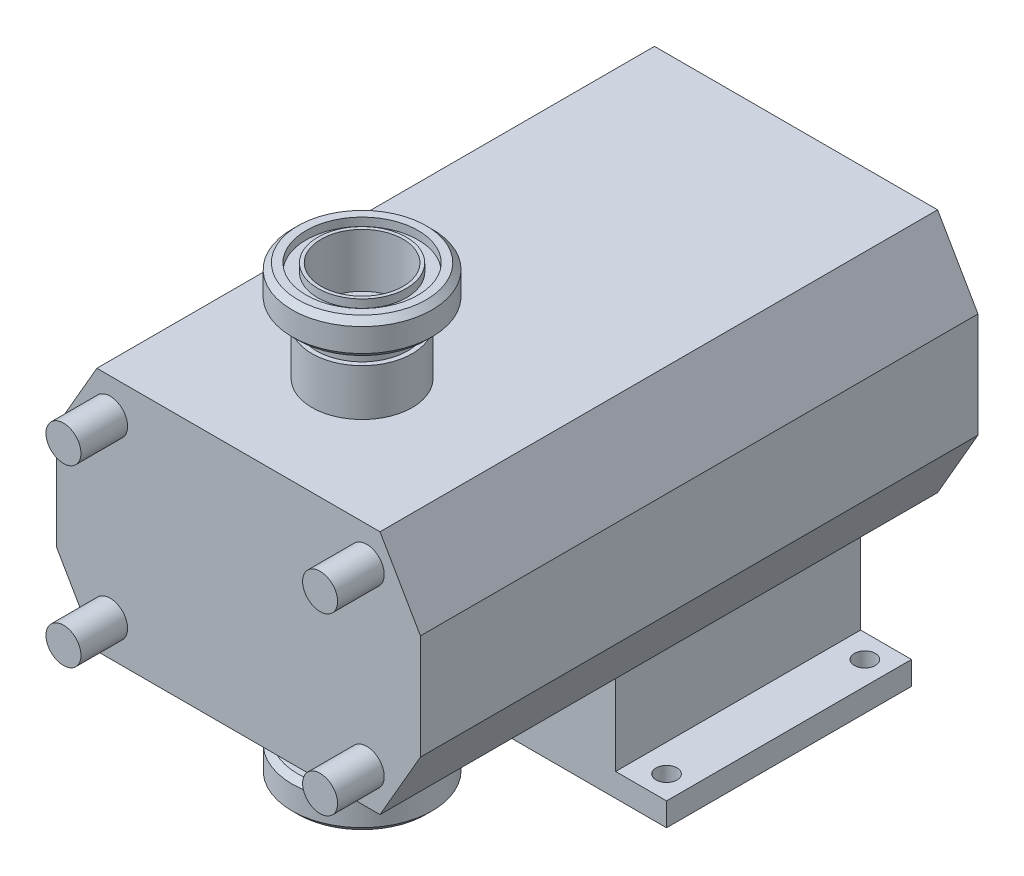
ISO-10303-21;
HEADER;
FILE_DESCRIPTION(('STEP AP214'),'2;1');
FILE_NAME('part.step','',(''),(''),'','','');
FILE_SCHEMA(('AUTOMOTIVE_DESIGN { 1 0 10303 214 1 1 1 1 }'));
ENDSEC;
DATA;
#1=APPLICATION_CONTEXT('core data for automotive mechanical design processes');
#2=APPLICATION_PROTOCOL_DEFINITION('international standard','automotive_design',2000,#1);
#3=PRODUCT_CONTEXT('',#1,'mechanical');
#4=PRODUCT('Part','Part','',(#3));
#5=PRODUCT_RELATED_PRODUCT_CATEGORY('part','',(#4));
#6=PRODUCT_DEFINITION_FORMATION('','',#4);
#7=PRODUCT_DEFINITION_CONTEXT('part definition',#1,'design');
#8=PRODUCT_DEFINITION('design','',#6,#7);
#9=PRODUCT_DEFINITION_SHAPE('','',#8);
#10=(LENGTH_UNIT() NAMED_UNIT(*) SI_UNIT(.MILLI.,.METRE.));
#11=(NAMED_UNIT(*) PLANE_ANGLE_UNIT() SI_UNIT($,.RADIAN.));
#12=(NAMED_UNIT(*) SI_UNIT($,.STERADIAN.) SOLID_ANGLE_UNIT());
#13=UNCERTAINTY_MEASURE_WITH_UNIT(LENGTH_MEASURE(1.E-05),#10,'distance_accuracy_value','');
#14=(GEOMETRIC_REPRESENTATION_CONTEXT(3) GLOBAL_UNCERTAINTY_ASSIGNED_CONTEXT((#13)) GLOBAL_UNIT_ASSIGNED_CONTEXT((#10,
#11,#12)) REPRESENTATION_CONTEXT('',''));
#15=CARTESIAN_POINT('',(0.,0.,0.));
#16=DIRECTION('',(0.,0.,1.));
#17=DIRECTION('',(1.,0.,0.));
#18=AXIS2_PLACEMENT_3D('',#15,#16,#17);
#19=CARTESIAN_POINT('',(16.0545380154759,92.,196.161289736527));
#20=DIRECTION('',(0.,1.,0.));
#21=DIRECTION('',(-0.534804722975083,0.,0.844975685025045));
#22=AXIS2_PLACEMENT_3D('',#19,#20,#21);
#23=PLANE('',#22);
#24=CARTESIAN_POINT('',(0.,92.,186.));
#25=DIRECTION('',(0.,-1.,0.));
#26=DIRECTION('',(0.534804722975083,0.,-0.844975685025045));
#27=AXIS2_PLACEMENT_3D('',#24,#25,#26);
#28=CIRCLE('',#27,19.);
#29=CARTESIAN_POINT('',(10.1612897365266,92.,169.945461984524));
#30=VERTEX_POINT('',#29);
#31=EDGE_CURVE('P0_E58',#30,#30,#28,.T.);
#32=ORIENTED_EDGE('',*,*,#31,.T.);
#33=EDGE_LOOP('',(#32));
#34=FACE_BOUND('',#33,.T.);
#35=CARTESIAN_POINT('',(0.,92.,186.));
#36=DIRECTION('',(0.,-1.,0.));
#37=DIRECTION('',(0.534804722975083,0.,-0.844975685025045));
#38=AXIS2_PLACEMENT_3D('',#35,#36,#37);
#39=CIRCLE('',#38,24.);
#40=CARTESIAN_POINT('',(12.835313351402,92.,165.720583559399));
#41=VERTEX_POINT('',#40);
#42=EDGE_CURVE('P0_E10',#41,#41,#39,.T.);
#43=ORIENTED_EDGE('',*,*,#42,.F.);
#44=EDGE_LOOP('',(#43));
#45=FACE_BOUND('',#44,.T.);
#46=ADVANCED_FACE('P0_F15',(#34,#45),#23,.T.);
#47=CARTESIAN_POINT('',(0.,72.5,186.));
#48=DIRECTION('',(0.,-1.,0.));
#49=DIRECTION('',(0.534804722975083,0.,-0.844975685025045));
#50=AXIS2_PLACEMENT_3D('',#47,#48,#49);
#51=CYLINDRICAL_SURFACE('',#50,24.);
#52=ORIENTED_EDGE('',*,*,#42,.T.);
#53=EDGE_LOOP('',(#52));
#54=FACE_BOUND('',#53,.T.);
#55=CARTESIAN_POINT('',(0.,95.5,186.));
#56=DIRECTION('',(0.,-1.,0.));
#57=DIRECTION('',(0.534804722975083,0.,-0.844975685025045));
#58=AXIS2_PLACEMENT_3D('',#55,#56,#57);
#59=CIRCLE('',#58,24.);
#60=CARTESIAN_POINT('',(12.835313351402,95.5,165.720583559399));
#61=VERTEX_POINT('',#60);
#62=EDGE_CURVE('P0_E21',#61,#61,#59,.T.);
#63=ORIENTED_EDGE('',*,*,#62,.F.);
#64=EDGE_LOOP('',(#63));
#65=FACE_BOUND('',#64,.T.);
#66=ADVANCED_FACE('P0_F77',(#54,#65),#51,.F.);
#67=CARTESIAN_POINT('',(20.2794164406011,95.5,198.835313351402));
#68=DIRECTION('',(0.,1.,0.));
#69=DIRECTION('',(-0.534804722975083,0.,0.844975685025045));
#70=AXIS2_PLACEMENT_3D('',#67,#68,#69);
#71=PLANE('',#70);
#72=ORIENTED_EDGE('',*,*,#62,.T.);
#73=EDGE_LOOP('',(#72));
#74=FACE_BOUND('',#73,.T.);
#75=CARTESIAN_POINT('',(0.,95.5,186.));
#76=DIRECTION('',(0.,-1.,0.));
#77=DIRECTION('',(0.534804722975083,0.,-0.844975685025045));
#78=AXIS2_PLACEMENT_3D('',#75,#76,#77);
#79=CIRCLE('',#78,27.5);
#80=CARTESIAN_POINT('',(14.7071298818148,95.5,162.763168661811));
#81=VERTEX_POINT('',#80);
#82=EDGE_CURVE('P0_E25',#81,#81,#79,.T.);
#83=ORIENTED_EDGE('',*,*,#82,.F.);
#84=EDGE_LOOP('',(#83));
#85=FACE_BOUND('',#84,.T.);
#86=ADVANCED_FACE('P0_F81',(#74,#85),#71,.T.);
#87=CARTESIAN_POINT('',(0.,93.0000000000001,186.));
#88=DIRECTION('',(0.,-1.,0.));
#89=DIRECTION('',(0.534804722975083,0.,-0.844975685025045));
#90=AXIS2_PLACEMENT_3D('',#87,#88,#89);
#91=CONICAL_SURFACE('',#90,30.,0.785398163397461);
#92=ORIENTED_EDGE('',*,*,#82,.T.);
#93=EDGE_LOOP('',(#92));
#94=FACE_BOUND('',#93,.T.);
#95=CARTESIAN_POINT('',(0.,93.0000000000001,186.));
#96=DIRECTION('',(0.,-1.,0.));
#97=DIRECTION('',(0.534804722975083,0.,-0.844975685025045));
#98=AXIS2_PLACEMENT_3D('',#95,#96,#97);
#99=CIRCLE('',#98,30.);
#100=CARTESIAN_POINT('',(16.0441416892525,93.0000000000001,160.650729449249));
#101=VERTEX_POINT('',#100);
#102=EDGE_CURVE('P0_E29',#101,#101,#99,.T.);
#103=ORIENTED_EDGE('',*,*,#102,.F.);
#104=EDGE_LOOP('',(#103));
#105=FACE_BOUND('',#104,.T.);
#106=ADVANCED_FACE('P0_F85',(#94,#105),#91,.T.);
#107=CARTESIAN_POINT('',(0.,72.5,186.));
#108=DIRECTION('',(0.,-1.,0.));
#109=DIRECTION('',(0.534804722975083,0.,-0.844975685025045));
#110=AXIS2_PLACEMENT_3D('',#107,#108,#109);
#111=CYLINDRICAL_SURFACE('',#110,30.);
#112=ORIENTED_EDGE('',*,*,#102,.T.);
#113=EDGE_LOOP('',(#112));
#114=FACE_BOUND('',#113,.T.);
#115=CARTESIAN_POINT('',(0.,83.,186.));
#116=DIRECTION('',(0.,-1.,0.));
#117=DIRECTION('',(0.534804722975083,0.,-0.844975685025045));
#118=AXIS2_PLACEMENT_3D('',#115,#116,#117);
#119=CIRCLE('',#118,30.);
#120=CARTESIAN_POINT('',(16.0441416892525,83.,160.650729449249));
#121=VERTEX_POINT('',#120);
#122=EDGE_CURVE('P0_E34',#121,#121,#119,.T.);
#123=ORIENTED_EDGE('',*,*,#122,.F.);
#124=EDGE_LOOP('',(#123));
#125=FACE_BOUND('',#124,.T.);
#126=ADVANCED_FACE('P0_F91',(#114,#125),#111,.T.);
#127=CARTESIAN_POINT('',(0.,80.5,186.));
#128=DIRECTION('',(0.,1.,0.));
#129=DIRECTION('',(-0.534804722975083,0.,0.844975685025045));
#130=AXIS2_PLACEMENT_3D('',#127,#128,#129);
#131=CONICAL_SURFACE('',#130,27.5,0.785398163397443);
#132=ORIENTED_EDGE('',*,*,#122,.T.);
#133=EDGE_LOOP('',(#132));
#134=FACE_BOUND('',#133,.T.);
#135=CARTESIAN_POINT('',(0.,80.5,186.));
#136=DIRECTION('',(0.,-1.,0.));
#137=DIRECTION('',(0.534804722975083,0.,-0.844975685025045));
#138=AXIS2_PLACEMENT_3D('',#135,#136,#137);
#139=CIRCLE('',#138,27.5);
#140=CARTESIAN_POINT('',(14.7071298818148,80.5,162.763168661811));
#141=VERTEX_POINT('',#140);
#142=EDGE_CURVE('P0_E37',#141,#141,#139,.T.);
#143=ORIENTED_EDGE('',*,*,#142,.F.);
#144=EDGE_LOOP('',(#143));
#145=FACE_BOUND('',#144,.T.);
#146=ADVANCED_FACE('P0_F95',(#134,#145),#131,.T.);
#147=CARTESIAN_POINT('',(23.2368313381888,80.5,200.707129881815));
#148=DIRECTION('',(0.,-1.,0.));
#149=DIRECTION('',(0.534804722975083,0.,-0.844975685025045));
#150=AXIS2_PLACEMENT_3D('',#147,#148,#149);
#151=PLANE('',#150);
#152=ORIENTED_EDGE('',*,*,#142,.T.);
#153=EDGE_LOOP('',(#152));
#154=FACE_BOUND('',#153,.T.);
#155=CARTESIAN_POINT('',(0.,80.5,186.));
#156=DIRECTION('',(0.,-1.,0.));
#157=DIRECTION('',(0.534804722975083,0.,-0.844975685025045));
#158=AXIS2_PLACEMENT_3D('',#155,#156,#157);
#159=CIRCLE('',#158,22.);
#160=CARTESIAN_POINT('',(11.7657039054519,80.5,167.410534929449));
#161=VERTEX_POINT('',#160);
#162=EDGE_CURVE('P0_E40',#161,#161,#159,.T.);
#163=ORIENTED_EDGE('',*,*,#162,.F.);
#164=EDGE_LOOP('',(#163));
#165=FACE_BOUND('',#164,.T.);
#166=ADVANCED_FACE('P0_F99',(#154,#165),#151,.T.);
#167=CARTESIAN_POINT('',(0.,78.,186.));
#168=DIRECTION('',(0.,-1.,0.));
#169=DIRECTION('',(0.534804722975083,0.,-0.844975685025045));
#170=AXIS2_PLACEMENT_3D('',#167,#168,#169);
#171=TOROIDAL_SURFACE('',#170,22.,2.5);
#172=ORIENTED_EDGE('',*,*,#162,.T.);
#173=EDGE_LOOP('',(#172));
#174=FACE_BOUND('',#173,.T.);
#175=CARTESIAN_POINT('',(0.,78.,186.));
#176=DIRECTION('',(0.,-1.,0.));
#177=DIRECTION('',(0.534804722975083,0.,-0.844975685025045));
#178=AXIS2_PLACEMENT_3D('',#175,#176,#177);
#179=CIRCLE('',#178,19.5);
#180=CARTESIAN_POINT('',(10.4286920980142,78.,169.522974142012));
#181=VERTEX_POINT('',#180);
#182=EDGE_CURVE('P0_E43',#181,#181,#179,.T.);
#183=ORIENTED_EDGE('',*,*,#182,.F.);
#184=EDGE_LOOP('',(#183));
#185=FACE_BOUND('',#184,.T.);
#186=ADVANCED_FACE('P0_F103',(#174,#185),#171,.F.);
#187=CARTESIAN_POINT('',(0.,72.5,186.));
#188=DIRECTION('',(0.,-1.,0.));
#189=DIRECTION('',(0.534804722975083,0.,-0.844975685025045));
#190=AXIS2_PLACEMENT_3D('',#187,#188,#189);
#191=CYLINDRICAL_SURFACE('',#190,19.5);
#192=ORIENTED_EDGE('',*,*,#182,.T.);
#193=EDGE_LOOP('',(#192));
#194=FACE_BOUND('',#193,.T.);
#195=CARTESIAN_POINT('',(0.,72.5,186.));
#196=DIRECTION('',(0.,-1.,0.));
#197=DIRECTION('',(0.534804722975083,0.,-0.844975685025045));
#198=AXIS2_PLACEMENT_3D('',#195,#196,#197);
#199=CIRCLE('',#198,19.5);
#200=CARTESIAN_POINT('',(10.4286920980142,72.5,169.522974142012));
#201=VERTEX_POINT('',#200);
#202=EDGE_CURVE('P0_E46',#201,#201,#199,.T.);
#203=ORIENTED_EDGE('',*,*,#202,.F.);
#204=EDGE_LOOP('',(#203));
#205=FACE_BOUND('',#204,.T.);
#206=ADVANCED_FACE('P0_F107',(#194,#205),#191,.T.);
#207=CARTESIAN_POINT('',(16.4770258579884,72.5,196.428692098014));
#208=DIRECTION('',(0.,-1.,0.));
#209=DIRECTION('',(0.534804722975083,0.,-0.844975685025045));
#210=AXIS2_PLACEMENT_3D('',#207,#208,#209);
#211=PLANE('',#210);
#212=ORIENTED_EDGE('',*,*,#202,.T.);
#213=EDGE_LOOP('',(#212));
#214=FACE_BOUND('',#213,.T.);
#215=CARTESIAN_POINT('',(0.,72.5,186.));
#216=DIRECTION('',(0.,-1.,0.));
#217=DIRECTION('',(0.534804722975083,0.,-0.844975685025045));
#218=AXIS2_PLACEMENT_3D('',#215,#216,#217);
#219=CIRCLE('',#218,17.55);
#220=CARTESIAN_POINT('',(9.38582288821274,72.5,171.17067672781));
#221=VERTEX_POINT('',#220);
#222=EDGE_CURVE('P0_E49',#221,#221,#219,.T.);
#223=ORIENTED_EDGE('',*,*,#222,.F.);
#224=EDGE_LOOP('',(#223));
#225=FACE_BOUND('',#224,.T.);
#226=ADVANCED_FACE('P0_F111',(#214,#225),#211,.T.);
#227=CARTESIAN_POINT('',(0.,72.5,186.));
#228=DIRECTION('',(0.,-1.,0.));
#229=DIRECTION('',(0.534804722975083,0.,-0.844975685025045));
#230=AXIS2_PLACEMENT_3D('',#227,#228,#229);
#231=CYLINDRICAL_SURFACE('',#230,17.55);
#232=ORIENTED_EDGE('',*,*,#222,.T.);
#233=EDGE_LOOP('',(#232));
#234=FACE_BOUND('',#233,.T.);
#235=CARTESIAN_POINT('',(0.,95.5,186.));
#236=DIRECTION('',(0.,-1.,0.));
#237=DIRECTION('',(0.534804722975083,0.,-0.844975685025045));
#238=AXIS2_PLACEMENT_3D('',#235,#236,#237);
#239=CIRCLE('',#238,17.55);
#240=CARTESIAN_POINT('',(9.38582288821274,95.5,171.17067672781));
#241=VERTEX_POINT('',#240);
#242=EDGE_CURVE('P0_E52',#241,#241,#239,.T.);
#243=ORIENTED_EDGE('',*,*,#242,.F.);
#244=EDGE_LOOP('',(#243));
#245=FACE_BOUND('',#244,.T.);
#246=ADVANCED_FACE('P0_F73',(#234,#245),#231,.F.);
#247=CARTESIAN_POINT('',(14.8293232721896,95.5,195.385822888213));
#248=DIRECTION('',(0.,1.,0.));
#249=DIRECTION('',(-0.534804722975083,0.,0.844975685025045));
#250=AXIS2_PLACEMENT_3D('',#247,#248,#249);
#251=PLANE('',#250);
#252=ORIENTED_EDGE('',*,*,#242,.T.);
#253=EDGE_LOOP('',(#252));
#254=FACE_BOUND('',#253,.T.);
#255=CARTESIAN_POINT('',(0.,95.5,186.));
#256=DIRECTION('',(0.,-1.,0.));
#257=DIRECTION('',(0.534804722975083,0.,-0.844975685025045));
#258=AXIS2_PLACEMENT_3D('',#255,#256,#257);
#259=CIRCLE('',#258,19.);
#260=CARTESIAN_POINT('',(10.1612897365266,95.5,169.945461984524));
#261=VERTEX_POINT('',#260);
#262=EDGE_CURVE('P0_E55',#261,#261,#259,.T.);
#263=ORIENTED_EDGE('',*,*,#262,.F.);
#264=EDGE_LOOP('',(#263));
#265=FACE_BOUND('',#264,.T.);
#266=ADVANCED_FACE('P0_F66',(#254,#265),#251,.T.);
#267=CARTESIAN_POINT('',(0.,72.5,186.));
#268=DIRECTION('',(0.,-1.,0.));
#269=DIRECTION('',(0.534804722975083,0.,-0.844975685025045));
#270=AXIS2_PLACEMENT_3D('',#267,#268,#269);
#271=CYLINDRICAL_SURFACE('',#270,19.);
#272=ORIENTED_EDGE('',*,*,#262,.T.);
#273=EDGE_LOOP('',(#272));
#274=FACE_BOUND('',#273,.T.);
#275=ORIENTED_EDGE('',*,*,#31,.F.);
#276=EDGE_LOOP('',(#275));
#277=FACE_BOUND('',#276,.T.);
#278=ADVANCED_FACE('P0_F64',(#274,#277),#271,.T.);
#279=CLOSED_SHELL('',(#46,#66,#86,#106,#126,#146,#166,#186,#206,#226,#246,#266,#278));
#280=MANIFOLD_SOLID_BREP('P0_B1',#279);
#281=CARTESIAN_POINT('',(-25.,0.,241.732657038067));
#282=DIRECTION('',(0.,0.,1.));
#283=DIRECTION('',(1.,0.,0.));
#284=AXIS2_PLACEMENT_3D('',#281,#282,#283);
#285=CYLINDRICAL_SURFACE('',#284,9.5);
#286=CARTESIAN_POINT('',(-25.,0.,-2.));
#287=DIRECTION('',(0.,0.,1.));
#288=DIRECTION('',(1.,0.,0.));
#289=AXIS2_PLACEMENT_3D('',#286,#287,#288);
#290=CIRCLE('',#289,9.5);
#291=CARTESIAN_POINT('',(-15.5,0.,-2.));
#292=VERTEX_POINT('',#291);
#293=EDGE_CURVE('P1_E277',#292,#292,#290,.T.);
#294=ORIENTED_EDGE('',*,*,#293,.F.);
#295=EDGE_LOOP('',(#294));
#296=FACE_BOUND('',#295,.T.);
#297=DIRECTION('',(0.,0.,1.));
#298=VECTOR('',#297,1.);
#299=CARTESIAN_POINT('',(-15.98612181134,2.99999999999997,241.732657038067));
#300=LINE('',#299,#298);
#301=CARTESIAN_POINT('',(-15.98612181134,3.,-42.));
#302=VERTEX_POINT('',#301);
#303=CARTESIAN_POINT('',(-15.98612181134,3.,-22.));
#304=VERTEX_POINT('',#303);
#305=EDGE_CURVE('P1_E178',#302,#304,#300,.T.);
#306=ORIENTED_EDGE('',*,*,#305,.F.);
#307=CARTESIAN_POINT('',(-25.,0.,-42.));
#308=DIRECTION('',(0.,0.,1.));
#309=DIRECTION('',(1.,0.,0.));
#310=AXIS2_PLACEMENT_3D('',#307,#308,#309);
#311=CIRCLE('',#310,9.5);
#312=CARTESIAN_POINT('',(-15.98612181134,-3.,-42.));
#313=VERTEX_POINT('',#312);
#314=EDGE_CURVE('P1_E176',#302,#313,#311,.T.);
#315=ORIENTED_EDGE('',*,*,#314,.T.);
#316=DIRECTION('',(0.,0.,1.));
#317=VECTOR('',#316,1.);
#318=CARTESIAN_POINT('',(-15.98612181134,-3.00000000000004,241.732657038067));
#319=LINE('',#318,#317);
#320=CARTESIAN_POINT('',(-15.98612181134,-3.00000000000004,-22.));
#321=VERTEX_POINT('',#320);
#322=EDGE_CURVE('P1_E39',#321,#313,#319,.F.);
#323=ORIENTED_EDGE('',*,*,#322,.F.);
#324=CARTESIAN_POINT('',(-15.5,0.,-25.));
#325=CARTESIAN_POINT('',(-15.5000006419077,0.16416708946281,-24.9999991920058));
#326=CARTESIAN_POINT('',(-15.5042954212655,0.328342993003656,-24.9864802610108));
#327=CARTESIAN_POINT('',(-15.5210070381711,0.651888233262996,-24.9329071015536));
#328=CARTESIAN_POINT('',(-15.5334255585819,0.811256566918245,-24.8928473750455));
#329=CARTESIAN_POINT('',(-15.5650291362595,1.12047453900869,-24.787682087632));
#330=CARTESIAN_POINT('',(-15.5842035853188,1.2703386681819,-24.7226157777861));
#331=CARTESIAN_POINT('',(-15.6273427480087,1.55702915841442,-24.5694529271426));
#332=CARTESIAN_POINT('',(-15.6513082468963,1.69385337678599,-24.4813526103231));
#333=CARTESIAN_POINT('',(-15.7023324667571,1.95488615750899,-24.2817053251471));
#334=CARTESIAN_POINT('',(-15.7294596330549,2.07862693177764,-24.1695643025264));
#335=CARTESIAN_POINT('',(-15.7833564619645,2.30589485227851,-23.9262834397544));
#336=CARTESIAN_POINT('',(-15.8101260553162,2.4094181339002,-23.7951399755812));
#337=CARTESIAN_POINT('',(-15.8610140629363,2.59586933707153,-23.5135024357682));
#338=CARTESIAN_POINT('',(-15.8850481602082,2.67820924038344,-23.3626023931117));
#339=CARTESIAN_POINT('',(-15.9267127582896,2.81614778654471,-23.0482150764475));
#340=CARTESIAN_POINT('',(-15.9443449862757,2.87175364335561,-22.8847312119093));
#341=CARTESIAN_POINT('',(-15.9704927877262,2.95292728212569,-22.5551021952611));
#342=CARTESIAN_POINT('',(-15.979271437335,2.97936420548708,-22.3891925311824));
#343=CARTESIAN_POINT('',(-15.9874987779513,3.00416514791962,-22.0550782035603));
#344=CARTESIAN_POINT('',(-15.9869500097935,3.00253681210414,-21.8868741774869));
#345=CARTESIAN_POINT('',(-15.9768164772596,2.97193247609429,-21.5601689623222));
#346=CARTESIAN_POINT('',(-15.9675982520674,2.94406576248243,-21.4015505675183));
#347=CARTESIAN_POINT('',(-15.9417605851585,2.86357596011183,-21.0913669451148));
#348=CARTESIAN_POINT('',(-15.9251403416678,2.81095018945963,-20.9398024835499));
#349=CARTESIAN_POINT('',(-15.8860934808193,2.68166168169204,-20.6454054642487));
#350=CARTESIAN_POINT('',(-15.8635843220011,2.60465367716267,-20.5027359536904));
#351=CARTESIAN_POINT('',(-15.8153331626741,2.4290264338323,-20.2319823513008));
#352=CARTESIAN_POINT('',(-15.7895903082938,2.33040148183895,-20.103902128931));
#353=CARTESIAN_POINT('',(-15.7363062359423,2.10891443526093,-19.859697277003));
#354=CARTESIAN_POINT('',(-15.7087370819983,1.98513792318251,-19.7444065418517));
#355=CARTESIAN_POINT('',(-15.6559621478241,1.71966506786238,-19.5360135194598));
#356=CARTESIAN_POINT('',(-15.6307565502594,1.57796734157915,-19.4429129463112));
#357=CARTESIAN_POINT('',(-15.5852743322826,1.27904248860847,-19.2809619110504));
#358=CARTESIAN_POINT('',(-15.5650393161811,1.12169880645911,-19.2123141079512));
#359=CARTESIAN_POINT('',(-15.5320787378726,0.796908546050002,-19.102710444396));
#360=CARTESIAN_POINT('',(-15.5193508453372,0.629465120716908,-19.0617459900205));
#361=CARTESIAN_POINT('',(-15.5032152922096,0.296303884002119,-19.0101010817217));
#362=CARTESIAN_POINT('',(-15.4994604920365,0.130777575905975,-18.9982920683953));
#363=CARTESIAN_POINT('',(-15.5006652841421,-0.199911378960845,-19.0021062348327));
#364=CARTESIAN_POINT('',(-15.5056235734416,-0.365074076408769,-19.017725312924));
#365=CARTESIAN_POINT('',(-15.5234691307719,-0.685969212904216,-19.0750481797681));
#366=CARTESIAN_POINT('',(-15.5361511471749,-0.841834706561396,-19.1160771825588));
#367=CARTESIAN_POINT('',(-15.5679556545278,-1.14442314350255,-19.2222287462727));
#368=CARTESIAN_POINT('',(-15.5870789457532,-1.2911449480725,-19.2873543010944));
#369=CARTESIAN_POINT('',(-15.6303910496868,-1.57531276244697,-19.4416461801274));
#370=CARTESIAN_POINT('',(-15.6546933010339,-1.71244019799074,-19.5313665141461));
#371=CARTESIAN_POINT('',(-15.7055878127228,-1.97006979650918,-19.7316386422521));
#372=CARTESIAN_POINT('',(-15.7321807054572,-2.09056734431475,-19.8421961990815));
#373=CARTESIAN_POINT('',(-15.7860170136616,-2.31658675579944,-20.0863131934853));
#374=CARTESIAN_POINT('',(-15.813243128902,-2.42130400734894,-20.2206231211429));
#375=CARTESIAN_POINT('',(-15.8641405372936,-2.60679013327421,-20.5055000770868));
#376=CARTESIAN_POINT('',(-15.8878118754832,-2.68755931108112,-20.6560668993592));
#377=CARTESIAN_POINT('',(-15.9286607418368,-2.82237097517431,-20.9689238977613));
#378=CARTESIAN_POINT('',(-15.9458617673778,-2.87651039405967,-21.1311690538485));
#379=CARTESIAN_POINT('',(-15.9716606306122,-2.95649944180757,-21.4631296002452));
#380=CARTESIAN_POINT('',(-15.9802618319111,-2.9823601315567,-21.6328420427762));
#381=CARTESIAN_POINT('',(-15.9875316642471,-3.0042524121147,-21.9664938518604));
#382=CARTESIAN_POINT('',(-15.9866406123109,-3.00160628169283,-22.1303379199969));
#383=CARTESIAN_POINT('',(-15.9760989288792,-2.96976166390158,-22.4551233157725));
#384=CARTESIAN_POINT('',(-15.9664487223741,-2.94056446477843,-22.6160647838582));
#385=CARTESIAN_POINT('',(-15.9397869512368,-2.8573397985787,-22.928056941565));
#386=CARTESIAN_POINT('',(-15.9228900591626,-2.80369834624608,-23.0792211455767));
#387=CARTESIAN_POINT('',(-15.8836701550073,-2.67341300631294,-23.3705239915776));
#388=CARTESIAN_POINT('',(-15.8613460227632,-2.59676436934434,-23.5106603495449));
#389=CARTESIAN_POINT('',(-15.8126776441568,-2.4190708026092,-23.781973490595));
#390=CARTESIAN_POINT('',(-15.7862086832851,-2.31717569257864,-23.9125710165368));
#391=CARTESIAN_POINT('',(-15.7327983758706,-2.0933684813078,-24.1552416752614));
#392=CARTESIAN_POINT('',(-15.705856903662,-1.97145098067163,-24.2673097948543));
#393=CARTESIAN_POINT('',(-15.6534511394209,-1.7061326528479,-24.4735138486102));
#394=CARTESIAN_POINT('',(-15.6280668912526,-1.56214764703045,-24.5669207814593));
#395=CARTESIAN_POINT('',(-15.5826524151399,-1.25971894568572,-24.728083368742));
#396=CARTESIAN_POINT('',(-15.5626201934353,-1.10128066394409,-24.7958485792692));
#397=CARTESIAN_POINT('',(-15.531467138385,-0.787271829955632,-24.8991975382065));
#398=CARTESIAN_POINT('',(-15.5197707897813,-0.632450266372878,-24.9368877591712));
#399=CARTESIAN_POINT('',(-15.5040377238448,-0.318421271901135,-24.9872867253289));
#400=CARTESIAN_POINT('',(-15.4999993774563,-0.159214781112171,-25.00000078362));
#401=CARTESIAN_POINT('',(-15.5,0.,-25.));
#402=B_SPLINE_CURVE_WITH_KNOTS('',3,(#324,#325,#326,#327,#328,#329,#330,#331,#332,#333,#334,
#335,#336,#337,#338,#339,#340,#341,#342,#343,#344,#345,#346,#347,#348,#349,#350,#351,#352,#353,
#354,#355,#356,#357,#358,#359,#360,#361,#362,#363,#364,#365,#366,#367,#368,#369,#370,#371,#372,
#373,#374,#375,#376,#377,#378,#379,#380,#381,#382,#383,#384,#385,#386,#387,#388,#389,#390,#391,
#392,#393,#394,#395,#396,#397,#398,#399,#400,#401),.UNSPECIFIED.,.T.,.F.,(4,2,2,2,2,2,2,2,2,2,2,
2,2,2,2,2,2,2,2,2,2,2,2,2,2,2,2,2,2,2,2,2,2,2,2,2,2,2,4),(0.,0.491915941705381,
0.983933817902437,1.47518254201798,1.96651184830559,2.47177433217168,2.97713330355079,
3.49529138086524,4.0133095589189,4.51543663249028,5.01742692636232,5.49910423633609,
5.98083373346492,6.46971527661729,6.95872618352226,7.47049694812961,7.98230723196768,
8.49826565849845,9.01406383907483,9.50955937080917,10.0049808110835,10.487778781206,
10.9706367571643,11.4654198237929,11.9603399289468,12.4753133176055,12.9902801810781,
13.5033584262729,14.0162359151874,14.5054301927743,14.9946007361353,15.4763007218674,
15.9581002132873,16.4590917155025,16.9602185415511,17.4781824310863,17.9959530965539,
18.4731312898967,18.9502079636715),.UNSPECIFIED.);
#403=EDGE_CURVE('P1_E11',#304,#321,#402,.T.);
#404=ORIENTED_EDGE('',*,*,#403,.F.);
#405=EDGE_LOOP('',(#306,#315,#323,#404));
#406=FACE_BOUND('',#405,.T.);
#407=ADVANCED_FACE('P1_F17',(#296,#406),#285,.T.);
#408=CARTESIAN_POINT('',(-60.6794919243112,-52.5,239.));
#409=DIRECTION('',(0.,1.,0.));
#410=DIRECTION('',(-1.,0.,0.));
#411=AXIS2_PLACEMENT_3D('',#408,#409,#410);
#412=PLANE('',#411);
#413=CARTESIAN_POINT('',(0.,-52.5,186.));
#414=DIRECTION('',(0.,1.,0.));
#415=DIRECTION('',(-1.,0.,0.));
#416=AXIS2_PLACEMENT_3D('',#413,#414,#415);
#417=CIRCLE('',#416,21.5);
#418=CARTESIAN_POINT('',(-21.5,-52.5,186.));
#419=VERTEX_POINT('',#418);
#420=EDGE_CURVE('P1_E192',#419,#419,#417,.T.);
#421=ORIENTED_EDGE('',*,*,#420,.T.);
#422=EDGE_LOOP('',(#421));
#423=FACE_BOUND('',#422,.T.);
#424=DIRECTION('',(1.,0.,0.));
#425=VECTOR('',#424,1.);
#426=CARTESIAN_POINT('',(-60.6794919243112,-52.5,0.));
#427=LINE('',#426,#425);
#428=CARTESIAN_POINT('',(-60.6794919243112,-52.5,0.));
#429=VERTEX_POINT('',#428);
#430=CARTESIAN_POINT('',(60.6794919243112,-52.5,0.));
#431=VERTEX_POINT('',#430);
#432=EDGE_CURVE('P1_E337',#429,#431,#427,.T.);
#433=ORIENTED_EDGE('',*,*,#432,.T.);
#434=DIRECTION('',(0.,0.,-1.));
#435=VECTOR('',#434,1.);
#436=CARTESIAN_POINT('',(60.6794919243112,-52.5,239.));
#437=LINE('',#436,#435);
#438=CARTESIAN_POINT('',(60.6794919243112,-52.5,239.));
#439=VERTEX_POINT('',#438);
#440=EDGE_CURVE('P1_E347',#439,#431,#437,.T.);
#441=ORIENTED_EDGE('',*,*,#440,.F.);
#442=DIRECTION('',(1.,0.,0.));
#443=VECTOR('',#442,1.);
#444=CARTESIAN_POINT('',(-60.6794919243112,-52.5,239.));
#445=LINE('',#444,#443);
#446=CARTESIAN_POINT('',(-60.6794919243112,-52.5,239.));
#447=VERTEX_POINT('',#446);
#448=EDGE_CURVE('P1_E320',#447,#439,#445,.T.);
#449=ORIENTED_EDGE('',*,*,#448,.F.);
#450=DIRECTION('',(0.,0.,-1.));
#451=VECTOR('',#450,1.);
#452=CARTESIAN_POINT('',(-60.6794919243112,-52.5,239.));
#453=LINE('',#452,#451);
#454=EDGE_CURVE('P1_E350',#447,#429,#453,.T.);
#455=ORIENTED_EDGE('',*,*,#454,.T.);
#456=EDGE_LOOP('',(#433,#441,#449,#455));
#457=FACE_BOUND('',#456,.T.);
#458=DIRECTION('',(1.,0.,0.));
#459=VECTOR('',#458,1.);
#460=CARTESIAN_POINT('',(45.6794919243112,-52.5,18.));
#461=LINE('',#460,#459);
#462=CARTESIAN_POINT('',(-45.6794919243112,-52.5,18.));
#463=VERTEX_POINT('',#462);
#464=CARTESIAN_POINT('',(45.6794919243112,-52.5,18.));
#465=VERTEX_POINT('',#464);
#466=EDGE_CURVE('P1_E220',#463,#465,#461,.T.);
#467=ORIENTED_EDGE('',*,*,#466,.F.);
#468=DIRECTION('',(0.,0.,1.));
#469=VECTOR('',#468,1.);
#470=CARTESIAN_POINT('',(-45.6794919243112,-52.5,18.));
#471=LINE('',#470,#469);
#472=CARTESIAN_POINT('',(-45.6794919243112,-52.5,123.));
#473=VERTEX_POINT('',#472);
#474=EDGE_CURVE('P1_E238',#463,#473,#471,.T.);
#475=ORIENTED_EDGE('',*,*,#474,.T.);
#476=DIRECTION('',(1.,0.,0.));
#477=VECTOR('',#476,1.);
#478=CARTESIAN_POINT('',(45.6794919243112,-52.5,123.));
#479=LINE('',#478,#477);
#480=CARTESIAN_POINT('',(45.6794919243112,-52.5,123.));
#481=VERTEX_POINT('',#480);
#482=EDGE_CURVE('P1_E219',#473,#481,#479,.T.);
#483=ORIENTED_EDGE('',*,*,#482,.T.);
#484=DIRECTION('',(0.,0.,1.));
#485=VECTOR('',#484,1.);
#486=CARTESIAN_POINT('',(45.6794919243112,-52.5,18.));
#487=LINE('',#486,#485);
#488=EDGE_CURVE('P1_E274',#465,#481,#487,.T.);
#489=ORIENTED_EDGE('',*,*,#488,.F.);
#490=EDGE_LOOP('',(#467,#475,#483,#489));
#491=FACE_BOUND('',#490,.T.);
#492=ADVANCED_FACE('P1_F393',(#423,#457,#491),#412,.F.);
#493=CARTESIAN_POINT('',(90.9903810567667,0.,0.));
#494=DIRECTION('',(0.,0.,1.));
#495=DIRECTION('',(1.,0.,0.));
#496=AXIS2_PLACEMENT_3D('',#493,#494,#495);
#497=PLANE('',#496);
#498=DIRECTION('',(-0.500000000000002,0.866025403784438,0.));
#499=VECTOR('',#498,1.);
#500=CARTESIAN_POINT('',(60.6794919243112,52.5,0.));
#501=LINE('',#500,#499);
#502=CARTESIAN_POINT('',(78.,22.5,0.));
#503=VERTEX_POINT('',#502);
#504=CARTESIAN_POINT('',(60.6794919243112,52.5,0.));
#505=VERTEX_POINT('',#504);
#506=EDGE_CURVE('P1_E305',#503,#505,#501,.T.);
#507=ORIENTED_EDGE('',*,*,#506,.F.);
#508=DIRECTION('',(0.,1.,0.));
#509=VECTOR('',#508,1.);
#510=CARTESIAN_POINT('',(78.,22.5,0.));
#511=LINE('',#510,#509);
#512=CARTESIAN_POINT('',(78.,-22.5,0.));
#513=VERTEX_POINT('',#512);
#514=EDGE_CURVE('P1_E312',#513,#503,#511,.T.);
#515=ORIENTED_EDGE('',*,*,#514,.F.);
#516=DIRECTION('',(0.500000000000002,0.866025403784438,0.));
#517=VECTOR('',#516,1.);
#518=CARTESIAN_POINT('',(60.6794919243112,-52.5,0.));
#519=LINE('',#518,#517);
#520=EDGE_CURVE('P1_E339',#431,#513,#519,.T.);
#521=ORIENTED_EDGE('',*,*,#520,.F.);
#522=ORIENTED_EDGE('',*,*,#432,.F.);
#523=DIRECTION('',(0.500000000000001,-0.866025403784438,0.));
#524=VECTOR('',#523,1.);
#525=CARTESIAN_POINT('',(-60.6794919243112,-52.5,0.));
#526=LINE('',#525,#524);
#527=CARTESIAN_POINT('',(-78.,-22.5,0.));
#528=VERTEX_POINT('',#527);
#529=EDGE_CURVE('P1_E335',#528,#429,#526,.T.);
#530=ORIENTED_EDGE('',*,*,#529,.F.);
#531=DIRECTION('',(0.,-1.,0.));
#532=VECTOR('',#531,1.);
#533=CARTESIAN_POINT('',(-78.,22.5,0.));
#534=LINE('',#533,#532);
#535=CARTESIAN_POINT('',(-78.,22.5,0.));
#536=VERTEX_POINT('',#535);
#537=EDGE_CURVE('P1_E333',#536,#528,#534,.T.);
#538=ORIENTED_EDGE('',*,*,#537,.F.);
#539=DIRECTION('',(-0.500000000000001,-0.866025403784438,0.));
#540=VECTOR('',#539,1.);
#541=CARTESIAN_POINT('',(-60.6794919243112,52.5,0.));
#542=LINE('',#541,#540);
#543=CARTESIAN_POINT('',(-60.6794919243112,52.5,0.));
#544=VERTEX_POINT('',#543);
#545=EDGE_CURVE('P1_E331',#544,#536,#542,.T.);
#546=ORIENTED_EDGE('',*,*,#545,.F.);
#547=DIRECTION('',(-1.,0.,0.));
#548=VECTOR('',#547,1.);
#549=CARTESIAN_POINT('',(-60.6794919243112,52.5,0.));
#550=LINE('',#549,#548);
#551=EDGE_CURVE('P1_E329',#505,#544,#550,.T.);
#552=ORIENTED_EDGE('',*,*,#551,.F.);
#553=EDGE_LOOP('',(#507,#515,#521,#522,#530,#538,#546,#552));
#554=FACE_BOUND('',#553,.T.);
#555=CARTESIAN_POINT('',(-25.,0.,0.));
#556=DIRECTION('',(0.,0.,1.));
#557=DIRECTION('',(1.,0.,0.));
#558=AXIS2_PLACEMENT_3D('',#555,#556,#557);
#559=CIRCLE('',#558,12.5);
#560=CARTESIAN_POINT('',(-12.5,0.,0.));
#561=VERTEX_POINT('',#560);
#562=EDGE_CURVE('P1_E29',#561,#561,#559,.F.);
#563=ORIENTED_EDGE('',*,*,#562,.F.);
#564=EDGE_LOOP('',(#563));
#565=FACE_BOUND('',#564,.T.);
#566=ADVANCED_FACE('P1_F399',(#554,#565),#497,.F.);
#567=CARTESIAN_POINT('',(90.9903810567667,0.,239.));
#568=DIRECTION('',(0.,0.,1.));
#569=DIRECTION('',(1.,0.,0.));
#570=AXIS2_PLACEMENT_3D('',#567,#568,#569);
#571=PLANE('',#570);
#572=CARTESIAN_POINT('',(55.,-37.5,239.));
#573=DIRECTION('',(0.,0.,1.));
#574=DIRECTION('',(1.,0.,0.));
#575=AXIS2_PLACEMENT_3D('',#572,#573,#574);
#576=CIRCLE('',#575,7.49999999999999);
#577=CARTESIAN_POINT('',(62.5,-37.5,239.));
#578=VERTEX_POINT('',#577);
#579=EDGE_CURVE('P1_E287',#578,#578,#576,.T.);
#580=ORIENTED_EDGE('',*,*,#579,.F.);
#581=EDGE_LOOP('',(#580));
#582=FACE_BOUND('',#581,.T.);
#583=CARTESIAN_POINT('',(-55.,37.5,239.));
#584=DIRECTION('',(0.,0.,1.));
#585=DIRECTION('',(1.,0.,0.));
#586=AXIS2_PLACEMENT_3D('',#583,#584,#585);
#587=CIRCLE('',#586,7.5);
#588=CARTESIAN_POINT('',(-47.5,37.5,239.));
#589=VERTEX_POINT('',#588);
#590=EDGE_CURVE('P1_E299',#589,#589,#587,.T.);
#591=ORIENTED_EDGE('',*,*,#590,.F.);
#592=EDGE_LOOP('',(#591));
#593=FACE_BOUND('',#592,.T.);
#594=DIRECTION('',(-0.500000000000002,0.866025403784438,0.));
#595=VECTOR('',#594,1.);
#596=CARTESIAN_POINT('',(60.6794919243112,52.5,239.));
#597=LINE('',#596,#595);
#598=CARTESIAN_POINT('',(78.,22.5,239.));
#599=VERTEX_POINT('',#598);
#600=CARTESIAN_POINT('',(60.6794919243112,52.5,239.));
#601=VERTEX_POINT('',#600);
#602=EDGE_CURVE('P1_E308',#599,#601,#597,.T.);
#603=ORIENTED_EDGE('',*,*,#602,.T.);
#604=DIRECTION('',(-1.,0.,0.));
#605=VECTOR('',#604,1.);
#606=CARTESIAN_POINT('',(-60.6794919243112,52.5,239.));
#607=LINE('',#606,#605);
#608=CARTESIAN_POINT('',(-60.6794919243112,52.5,239.));
#609=VERTEX_POINT('',#608);
#610=EDGE_CURVE('P1_E311',#601,#609,#607,.T.);
#611=ORIENTED_EDGE('',*,*,#610,.T.);
#612=DIRECTION('',(-0.500000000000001,-0.866025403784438,0.));
#613=VECTOR('',#612,1.);
#614=CARTESIAN_POINT('',(-60.6794919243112,52.5,239.));
#615=LINE('',#614,#613);
#616=CARTESIAN_POINT('',(-78.,22.5,239.));
#617=VERTEX_POINT('',#616);
#618=EDGE_CURVE('P1_E314',#609,#617,#615,.T.);
#619=ORIENTED_EDGE('',*,*,#618,.T.);
#620=DIRECTION('',(0.,-1.,0.));
#621=VECTOR('',#620,1.);
#622=CARTESIAN_POINT('',(-78.,22.5,239.));
#623=LINE('',#622,#621);
#624=CARTESIAN_POINT('',(-78.,-22.5,239.));
#625=VERTEX_POINT('',#624);
#626=EDGE_CURVE('P1_E316',#617,#625,#623,.T.);
#627=ORIENTED_EDGE('',*,*,#626,.T.);
#628=DIRECTION('',(0.500000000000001,-0.866025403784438,0.));
#629=VECTOR('',#628,1.);
#630=CARTESIAN_POINT('',(-60.6794919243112,-52.5,239.));
#631=LINE('',#630,#629);
#632=EDGE_CURVE('P1_E318',#625,#447,#631,.T.);
#633=ORIENTED_EDGE('',*,*,#632,.T.);
#634=ORIENTED_EDGE('',*,*,#448,.T.);
#635=DIRECTION('',(0.500000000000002,0.866025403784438,0.));
#636=VECTOR('',#635,1.);
#637=CARTESIAN_POINT('',(60.6794919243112,-52.5,239.));
#638=LINE('',#637,#636);
#639=CARTESIAN_POINT('',(78.,-22.5,239.));
#640=VERTEX_POINT('',#639);
#641=EDGE_CURVE('P1_E322',#439,#640,#638,.T.);
#642=ORIENTED_EDGE('',*,*,#641,.T.);
#643=DIRECTION('',(0.,1.,0.));
#644=VECTOR('',#643,1.);
#645=CARTESIAN_POINT('',(78.,22.5,239.));
#646=LINE('',#645,#644);
#647=EDGE_CURVE('P1_E324',#640,#599,#646,.T.);
#648=ORIENTED_EDGE('',*,*,#647,.T.);
#649=EDGE_LOOP('',(#603,#611,#619,#627,#633,#634,#642,#648));
#650=FACE_BOUND('',#649,.T.);
#651=CARTESIAN_POINT('',(55.,37.5,239.));
#652=DIRECTION('',(0.,0.,1.));
#653=DIRECTION('',(1.,0.,0.));
#654=AXIS2_PLACEMENT_3D('',#651,#652,#653);
#655=CIRCLE('',#654,7.49999999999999);
#656=CARTESIAN_POINT('',(62.5,37.5,239.));
#657=VERTEX_POINT('',#656);
#658=EDGE_CURVE('P1_E293',#657,#657,#655,.T.);
#659=ORIENTED_EDGE('',*,*,#658,.F.);
#660=EDGE_LOOP('',(#659));
#661=FACE_BOUND('',#660,.T.);
#662=CARTESIAN_POINT('',(-55.,-37.5,239.));
#663=DIRECTION('',(0.,0.,1.));
#664=DIRECTION('',(1.,0.,0.));
#665=AXIS2_PLACEMENT_3D('',#662,#663,#664);
#666=CIRCLE('',#665,7.5);
#667=CARTESIAN_POINT('',(-47.5,-37.5,239.));
#668=VERTEX_POINT('',#667);
#669=EDGE_CURVE('P1_E283',#668,#668,#666,.T.);
#670=ORIENTED_EDGE('',*,*,#669,.F.);
#671=EDGE_LOOP('',(#670));
#672=FACE_BOUND('',#671,.T.);
#673=ADVANCED_FACE('P1_F448',(#582,#593,#650,#661,#672),#571,.T.);
#674=CARTESIAN_POINT('',(60.6794919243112,52.5,239.));
#675=DIRECTION('',(-0.866025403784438,-0.500000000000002,0.));
#676=DIRECTION('',(0.500000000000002,-0.866025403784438,0.));
#677=AXIS2_PLACEMENT_3D('',#674,#675,#676);
#678=PLANE('',#677);
#679=ORIENTED_EDGE('',*,*,#506,.T.);
#680=DIRECTION('',(0.,0.,-1.));
#681=VECTOR('',#680,1.);
#682=CARTESIAN_POINT('',(60.6794919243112,52.5,239.));
#683=LINE('',#682,#681);
#684=EDGE_CURVE('P1_E362',#601,#505,#683,.T.);
#685=ORIENTED_EDGE('',*,*,#684,.F.);
#686=ORIENTED_EDGE('',*,*,#602,.F.);
#687=DIRECTION('',(0.,0.,-1.));
#688=VECTOR('',#687,1.);
#689=CARTESIAN_POINT('',(78.,22.5,239.));
#690=LINE('',#689,#688);
#691=EDGE_CURVE('P1_E326',#599,#503,#690,.T.);
#692=ORIENTED_EDGE('',*,*,#691,.T.);
#693=EDGE_LOOP('',(#679,#685,#686,#692));
#694=FACE_BOUND('',#693,.T.);
#695=ADVANCED_FACE('P1_F19',(#694),#678,.F.);
#696=CARTESIAN_POINT('',(-60.6794919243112,52.5,239.));
#697=DIRECTION('',(0.,-1.,0.));
#698=DIRECTION('',(1.,0.,0.));
#699=AXIS2_PLACEMENT_3D('',#696,#697,#698);
#700=PLANE('',#699);
#701=CARTESIAN_POINT('',(0.,52.5,186.));
#702=DIRECTION('',(0.,-1.,0.));
#703=DIRECTION('',(1.,0.,0.));
#704=AXIS2_PLACEMENT_3D('',#701,#702,#703);
#705=CIRCLE('',#704,21.5);
#706=CARTESIAN_POINT('',(21.5,52.5,186.));
#707=VERTEX_POINT('',#706);
#708=EDGE_CURVE('P1_E191',#707,#707,#705,.T.);
#709=ORIENTED_EDGE('',*,*,#708,.T.);
#710=EDGE_LOOP('',(#709));
#711=FACE_BOUND('',#710,.T.);
#712=ORIENTED_EDGE('',*,*,#551,.T.);
#713=DIRECTION('',(0.,0.,-1.));
#714=VECTOR('',#713,1.);
#715=CARTESIAN_POINT('',(-60.6794919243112,52.5,239.));
#716=LINE('',#715,#714);
#717=EDGE_CURVE('P1_E359',#609,#544,#716,.T.);
#718=ORIENTED_EDGE('',*,*,#717,.F.);
#719=ORIENTED_EDGE('',*,*,#610,.F.);
#720=ORIENTED_EDGE('',*,*,#684,.T.);
#721=EDGE_LOOP('',(#712,#718,#719,#720));
#722=FACE_BOUND('',#721,.T.);
#723=ADVANCED_FACE('P1_F369',(#711,#722),#700,.F.);
#724=CARTESIAN_POINT('',(-60.6794919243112,52.5,239.));
#725=DIRECTION('',(0.866025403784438,-0.500000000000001,0.));
#726=DIRECTION('',(0.500000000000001,0.866025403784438,0.));
#727=AXIS2_PLACEMENT_3D('',#724,#725,#726);
#728=PLANE('',#727);
#729=ORIENTED_EDGE('',*,*,#545,.T.);
#730=DIRECTION('',(0.,0.,-1.));
#731=VECTOR('',#730,1.);
#732=CARTESIAN_POINT('',(-78.,22.5,239.));
#733=LINE('',#732,#731);
#734=EDGE_CURVE('P1_E356',#617,#536,#733,.T.);
#735=ORIENTED_EDGE('',*,*,#734,.F.);
#736=ORIENTED_EDGE('',*,*,#618,.F.);
#737=ORIENTED_EDGE('',*,*,#717,.T.);
#738=EDGE_LOOP('',(#729,#735,#736,#737));
#739=FACE_BOUND('',#738,.T.);
#740=ADVANCED_FACE('P1_F469',(#739),#728,.F.);
#741=CARTESIAN_POINT('',(-78.,22.5,239.));
#742=DIRECTION('',(1.,0.,0.));
#743=DIRECTION('',(0.,0.,-1.));
#744=AXIS2_PLACEMENT_3D('',#741,#742,#743);
#745=PLANE('',#744);
#746=ORIENTED_EDGE('',*,*,#537,.T.);
#747=DIRECTION('',(0.,0.,-1.));
#748=VECTOR('',#747,1.);
#749=CARTESIAN_POINT('',(-78.,-22.5,239.));
#750=LINE('',#749,#748);
#751=EDGE_CURVE('P1_E353',#625,#528,#750,.T.);
#752=ORIENTED_EDGE('',*,*,#751,.F.);
#753=ORIENTED_EDGE('',*,*,#626,.F.);
#754=ORIENTED_EDGE('',*,*,#734,.T.);
#755=EDGE_LOOP('',(#746,#752,#753,#754));
#756=FACE_BOUND('',#755,.T.);
#757=ADVANCED_FACE('P1_F465',(#756),#745,.F.);
#758=CARTESIAN_POINT('',(-60.6794919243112,-52.5,239.));
#759=DIRECTION('',(0.866025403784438,0.500000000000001,0.));
#760=DIRECTION('',(-0.500000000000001,0.866025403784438,0.));
#761=AXIS2_PLACEMENT_3D('',#758,#759,#760);
#762=PLANE('',#761);
#763=ORIENTED_EDGE('',*,*,#529,.T.);
#764=ORIENTED_EDGE('',*,*,#454,.F.);
#765=ORIENTED_EDGE('',*,*,#632,.F.);
#766=ORIENTED_EDGE('',*,*,#751,.T.);
#767=EDGE_LOOP('',(#763,#764,#765,#766));
#768=FACE_BOUND('',#767,.T.);
#769=ADVANCED_FACE('P1_F460',(#768),#762,.F.);
#770=CARTESIAN_POINT('',(60.6794919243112,-52.5,239.));
#771=DIRECTION('',(-0.866025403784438,0.500000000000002,0.));
#772=DIRECTION('',(-0.500000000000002,-0.866025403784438,0.));
#773=AXIS2_PLACEMENT_3D('',#770,#771,#772);
#774=PLANE('',#773);
#775=ORIENTED_EDGE('',*,*,#520,.T.);
#776=DIRECTION('',(0.,0.,-1.));
#777=VECTOR('',#776,1.);
#778=CARTESIAN_POINT('',(78.,-22.5,239.));
#779=LINE('',#778,#777);
#780=EDGE_CURVE('P1_E344',#640,#513,#779,.T.);
#781=ORIENTED_EDGE('',*,*,#780,.F.);
#782=ORIENTED_EDGE('',*,*,#641,.F.);
#783=ORIENTED_EDGE('',*,*,#440,.T.);
#784=EDGE_LOOP('',(#775,#781,#782,#783));
#785=FACE_BOUND('',#784,.T.);
#786=ADVANCED_FACE('P1_F457',(#785),#774,.F.);
#787=CARTESIAN_POINT('',(78.,22.5,239.));
#788=DIRECTION('',(-1.,0.,0.));
#789=DIRECTION('',(0.,0.,1.));
#790=AXIS2_PLACEMENT_3D('',#787,#788,#789);
#791=PLANE('',#790);
#792=ORIENTED_EDGE('',*,*,#514,.T.);
#793=ORIENTED_EDGE('',*,*,#691,.F.);
#794=ORIENTED_EDGE('',*,*,#647,.F.);
#795=ORIENTED_EDGE('',*,*,#780,.T.);
#796=EDGE_LOOP('',(#792,#793,#794,#795));
#797=FACE_BOUND('',#796,.T.);
#798=ADVANCED_FACE('P1_F446',(#797),#791,.F.);
#799=CARTESIAN_POINT('',(-55.,37.5,259.));
#800=DIRECTION('',(0.,0.,-1.));
#801=DIRECTION('',(-1.,0.,0.));
#802=AXIS2_PLACEMENT_3D('',#799,#800,#801);
#803=CYLINDRICAL_SURFACE('',#802,7.5);
#804=CARTESIAN_POINT('',(-55.,37.5,259.));
#805=DIRECTION('',(0.,0.,1.));
#806=DIRECTION('',(1.,0.,0.));
#807=AXIS2_PLACEMENT_3D('',#804,#805,#806);
#808=CIRCLE('',#807,7.5);
#809=CARTESIAN_POINT('',(-47.5,37.5,259.));
#810=VERTEX_POINT('',#809);
#811=EDGE_CURVE('P1_E302',#810,#810,#808,.T.);
#812=ORIENTED_EDGE('',*,*,#811,.F.);
#813=EDGE_LOOP('',(#812));
#814=FACE_BOUND('',#813,.T.);
#815=ORIENTED_EDGE('',*,*,#590,.T.);
#816=EDGE_LOOP('',(#815));
#817=FACE_BOUND('',#816,.T.);
#818=ADVANCED_FACE('P1_F442',(#814,#817),#803,.T.);
#819=CARTESIAN_POINT('',(-55.,37.5,259.));
#820=DIRECTION('',(0.,0.,1.));
#821=DIRECTION('',(1.,0.,0.));
#822=AXIS2_PLACEMENT_3D('',#819,#820,#821);
#823=PLANE('',#822);
#824=ORIENTED_EDGE('',*,*,#811,.T.);
#825=EDGE_LOOP('',(#824));
#826=FACE_BOUND('',#825,.T.);
#827=ADVANCED_FACE('P1_F438',(#826),#823,.T.);
#828=CARTESIAN_POINT('',(55.,37.5,259.));
#829=DIRECTION('',(0.,0.,-1.));
#830=DIRECTION('',(-1.,0.,0.));
#831=AXIS2_PLACEMENT_3D('',#828,#829,#830);
#832=CYLINDRICAL_SURFACE('',#831,7.49999999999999);
#833=CARTESIAN_POINT('',(55.,37.5,259.));
#834=DIRECTION('',(0.,0.,1.));
#835=DIRECTION('',(1.,0.,0.));
#836=AXIS2_PLACEMENT_3D('',#833,#834,#835);
#837=CIRCLE('',#836,7.49999999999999);
#838=CARTESIAN_POINT('',(62.5,37.5,259.));
#839=VERTEX_POINT('',#838);
#840=EDGE_CURVE('P1_E296',#839,#839,#837,.T.);
#841=ORIENTED_EDGE('',*,*,#840,.F.);
#842=EDGE_LOOP('',(#841));
#843=FACE_BOUND('',#842,.T.);
#844=ORIENTED_EDGE('',*,*,#658,.T.);
#845=EDGE_LOOP('',(#844));
#846=FACE_BOUND('',#845,.T.);
#847=ADVANCED_FACE('P1_F434',(#843,#846),#832,.T.);
#848=CARTESIAN_POINT('',(55.,37.5,259.));
#849=DIRECTION('',(0.,0.,1.));
#850=DIRECTION('',(1.,0.,0.));
#851=AXIS2_PLACEMENT_3D('',#848,#849,#850);
#852=PLANE('',#851);
#853=ORIENTED_EDGE('',*,*,#840,.T.);
#854=EDGE_LOOP('',(#853));
#855=FACE_BOUND('',#854,.T.);
#856=ADVANCED_FACE('P1_F430',(#855),#852,.T.);
#857=CARTESIAN_POINT('',(55.,-37.5,259.));
#858=DIRECTION('',(0.,0.,-1.));
#859=DIRECTION('',(-1.,0.,0.));
#860=AXIS2_PLACEMENT_3D('',#857,#858,#859);
#861=CYLINDRICAL_SURFACE('',#860,7.49999999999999);
#862=CARTESIAN_POINT('',(55.,-37.5,259.));
#863=DIRECTION('',(0.,0.,1.));
#864=DIRECTION('',(1.,0.,0.));
#865=AXIS2_PLACEMENT_3D('',#862,#863,#864);
#866=CIRCLE('',#865,7.49999999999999);
#867=CARTESIAN_POINT('',(62.5,-37.5,259.));
#868=VERTEX_POINT('',#867);
#869=EDGE_CURVE('P1_E290',#868,#868,#866,.T.);
#870=ORIENTED_EDGE('',*,*,#869,.F.);
#871=EDGE_LOOP('',(#870));
#872=FACE_BOUND('',#871,.T.);
#873=ORIENTED_EDGE('',*,*,#579,.T.);
#874=EDGE_LOOP('',(#873));
#875=FACE_BOUND('',#874,.T.);
#876=ADVANCED_FACE('P1_F426',(#872,#875),#861,.T.);
#877=CARTESIAN_POINT('',(55.,-37.5,259.));
#878=DIRECTION('',(0.,0.,1.));
#879=DIRECTION('',(1.,0.,0.));
#880=AXIS2_PLACEMENT_3D('',#877,#878,#879);
#881=PLANE('',#880);
#882=ORIENTED_EDGE('',*,*,#869,.T.);
#883=EDGE_LOOP('',(#882));
#884=FACE_BOUND('',#883,.T.);
#885=ADVANCED_FACE('P1_F422',(#884),#881,.T.);
#886=CARTESIAN_POINT('',(-55.,-37.5,259.));
#887=DIRECTION('',(0.,0.,-1.));
#888=DIRECTION('',(-1.,0.,0.));
#889=AXIS2_PLACEMENT_3D('',#886,#887,#888);
#890=CYLINDRICAL_SURFACE('',#889,7.5);
#891=CARTESIAN_POINT('',(-55.,-37.5,259.));
#892=DIRECTION('',(0.,0.,1.));
#893=DIRECTION('',(1.,0.,0.));
#894=AXIS2_PLACEMENT_3D('',#891,#892,#893);
#895=CIRCLE('',#894,7.5);
#896=CARTESIAN_POINT('',(-47.5,-37.5,259.));
#897=VERTEX_POINT('',#896);
#898=EDGE_CURVE('P1_E284',#897,#897,#895,.T.);
#899=ORIENTED_EDGE('',*,*,#898,.F.);
#900=EDGE_LOOP('',(#899));
#901=FACE_BOUND('',#900,.T.);
#902=ORIENTED_EDGE('',*,*,#669,.T.);
#903=EDGE_LOOP('',(#902));
#904=FACE_BOUND('',#903,.T.);
#905=ADVANCED_FACE('P1_F418',(#901,#904),#890,.T.);
#906=CARTESIAN_POINT('',(-55.,-37.5,259.));
#907=DIRECTION('',(0.,0.,1.));
#908=DIRECTION('',(1.,0.,0.));
#909=AXIS2_PLACEMENT_3D('',#906,#907,#908);
#910=PLANE('',#909);
#911=ORIENTED_EDGE('',*,*,#898,.T.);
#912=EDGE_LOOP('',(#911));
#913=FACE_BOUND('',#912,.T.);
#914=ADVANCED_FACE('P1_F414',(#913),#910,.T.);
#915=CARTESIAN_POINT('',(-25.,0.,241.732657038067));
#916=DIRECTION('',(0.,0.,1.));
#917=DIRECTION('',(1.,0.,0.));
#918=AXIS2_PLACEMENT_3D('',#915,#916,#917);
#919=CYLINDRICAL_SURFACE('',#918,12.5);
#920=ORIENTED_EDGE('',*,*,#562,.T.);
#921=EDGE_LOOP('',(#920));
#922=FACE_BOUND('',#921,.T.);
#923=CARTESIAN_POINT('',(-25.,0.,-2.));
#924=DIRECTION('',(0.,0.,1.));
#925=DIRECTION('',(1.,0.,0.));
#926=AXIS2_PLACEMENT_3D('',#923,#924,#925);
#927=CIRCLE('',#926,12.5);
#928=CARTESIAN_POINT('',(-12.5,0.,-2.));
#929=VERTEX_POINT('',#928);
#930=EDGE_CURVE('P1_E280',#929,#929,#927,.T.);
#931=ORIENTED_EDGE('',*,*,#930,.T.);
#932=EDGE_LOOP('',(#931));
#933=FACE_BOUND('',#932,.T.);
#934=ADVANCED_FACE('P1_F410',(#922,#933),#919,.T.);
#935=CARTESIAN_POINT('',(-25.,12.5,-2.));
#936=DIRECTION('',(0.,0.,1.));
#937=DIRECTION('',(1.,0.,0.));
#938=AXIS2_PLACEMENT_3D('',#935,#936,#937);
#939=PLANE('',#938);
#940=ORIENTED_EDGE('',*,*,#930,.F.);
#941=EDGE_LOOP('',(#940));
#942=FACE_BOUND('',#941,.T.);
#943=ORIENTED_EDGE('',*,*,#293,.T.);
#944=EDGE_LOOP('',(#943));
#945=FACE_BOUND('',#944,.T.);
#946=ADVANCED_FACE('P1_F407',(#942,#945),#939,.F.);
#947=CARTESIAN_POINT('',(-25.,9.5,-42.));
#948=DIRECTION('',(0.,0.,1.));
#949=DIRECTION('',(1.,0.,0.));
#950=AXIS2_PLACEMENT_3D('',#947,#948,#949);
#951=PLANE('',#950);
#952=ORIENTED_EDGE('',*,*,#314,.F.);
#953=DIRECTION('',(-1.,0.,0.));
#954=VECTOR('',#953,1.);
#955=CARTESIAN_POINT('',(-12.9,3.,-42.));
#956=LINE('',#955,#954);
#957=CARTESIAN_POINT('',(-12.9,3.,-42.));
#958=VERTEX_POINT('',#957);
#959=EDGE_CURVE('P1_E158',#958,#302,#956,.T.);
#960=ORIENTED_EDGE('',*,*,#959,.F.);
#961=DIRECTION('',(0.,1.,0.));
#962=VECTOR('',#961,1.);
#963=CARTESIAN_POINT('',(-12.9,3.,-42.));
#964=LINE('',#963,#962);
#965=CARTESIAN_POINT('',(-12.9,-3.,-42.));
#966=VERTEX_POINT('',#965);
#967=EDGE_CURVE('P1_E164',#966,#958,#964,.T.);
#968=ORIENTED_EDGE('',*,*,#967,.F.);
#969=DIRECTION('',(-1.,0.,0.));
#970=VECTOR('',#969,1.);
#971=CARTESIAN_POINT('',(-12.9,-3.,-42.));
#972=LINE('',#971,#970);
#973=EDGE_CURVE('P1_E768',#966,#313,#972,.T.);
#974=ORIENTED_EDGE('',*,*,#973,.T.);
#975=EDGE_LOOP('',(#952,#960,#968,#974));
#976=FACE_BOUND('',#975,.T.);
#977=ADVANCED_FACE('P1_F175',(#976),#951,.F.);
#978=CARTESIAN_POINT('',(45.6794919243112,-52.5,18.));
#979=DIRECTION('',(-1.,0.,0.));
#980=DIRECTION('',(0.,-1.,0.));
#981=AXIS2_PLACEMENT_3D('',#978,#979,#980);
#982=PLANE('',#981);
#983=DIRECTION('',(0.,-1.,0.));
#984=VECTOR('',#983,1.);
#985=CARTESIAN_POINT('',(45.6794919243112,-52.5,123.));
#986=LINE('',#985,#984);
#987=CARTESIAN_POINT('',(45.6794919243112,-102.,123.));
#988=VERTEX_POINT('',#987);
#989=EDGE_CURVE('P1_E241',#481,#988,#986,.T.);
#990=ORIENTED_EDGE('',*,*,#989,.T.);
#991=DIRECTION('',(0.,0.,1.));
#992=VECTOR('',#991,1.);
#993=CARTESIAN_POINT('',(45.6794919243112,-102.,18.));
#994=LINE('',#993,#992);
#995=CARTESIAN_POINT('',(45.6794919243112,-102.,18.));
#996=VERTEX_POINT('',#995);
#997=EDGE_CURVE('P1_E271',#996,#988,#994,.T.);
#998=ORIENTED_EDGE('',*,*,#997,.F.);
#999=DIRECTION('',(0.,-1.,0.));
#1000=VECTOR('',#999,1.);
#1001=CARTESIAN_POINT('',(45.6794919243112,-52.5,18.));
#1002=LINE('',#1001,#1000);
#1003=EDGE_CURVE('P1_E223',#465,#996,#1002,.T.);
#1004=ORIENTED_EDGE('',*,*,#1003,.F.);
#1005=ORIENTED_EDGE('',*,*,#488,.T.);
#1006=EDGE_LOOP('',(#990,#998,#1004,#1005));
#1007=FACE_BOUND('',#1006,.T.);
#1008=ADVANCED_FACE('P1_F529',(#1007),#982,.F.);
#1009=CARTESIAN_POINT('',(45.6794919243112,-102.,18.));
#1010=DIRECTION('',(0.,-1.,0.));
#1011=DIRECTION('',(1.,0.,0.));
#1012=AXIS2_PLACEMENT_3D('',#1009,#1010,#1011);
#1013=PLANE('',#1012);
#1014=CARTESIAN_POINT('',(57.5,-102.,28.));
#1015=DIRECTION('',(0.,-1.,0.));
#1016=DIRECTION('',(1.,0.,0.));
#1017=AXIS2_PLACEMENT_3D('',#1014,#1015,#1016);
#1018=CIRCLE('',#1017,4.5);
#1019=CARTESIAN_POINT('',(62.,-102.,28.));
#1020=VERTEX_POINT('',#1019);
#1021=EDGE_CURVE('P1_E207',#1020,#1020,#1018,.F.);
#1022=ORIENTED_EDGE('',*,*,#1021,.F.);
#1023=EDGE_LOOP('',(#1022));
#1024=FACE_BOUND('',#1023,.T.);
#1025=CARTESIAN_POINT('',(57.5,-102.,113.));
#1026=DIRECTION('',(0.,-1.,0.));
#1027=DIRECTION('',(1.,0.,0.));
#1028=AXIS2_PLACEMENT_3D('',#1025,#1026,#1027);
#1029=CIRCLE('',#1028,4.5);
#1030=CARTESIAN_POINT('',(62.,-102.,113.));
#1031=VERTEX_POINT('',#1030);
#1032=EDGE_CURVE('P1_E213',#1031,#1031,#1029,.F.);
#1033=ORIENTED_EDGE('',*,*,#1032,.F.);
#1034=EDGE_LOOP('',(#1033));
#1035=FACE_BOUND('',#1034,.T.);
#1036=DIRECTION('',(1.,0.,0.));
#1037=VECTOR('',#1036,1.);
#1038=CARTESIAN_POINT('',(45.6794919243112,-102.,123.));
#1039=LINE('',#1038,#1037);
#1040=CARTESIAN_POINT('',(67.5,-102.,123.));
#1041=VERTEX_POINT('',#1040);
#1042=EDGE_CURVE('P1_E243',#988,#1041,#1039,.T.);
#1043=ORIENTED_EDGE('',*,*,#1042,.T.);
#1044=DIRECTION('',(0.,0.,1.));
#1045=VECTOR('',#1044,1.);
#1046=CARTESIAN_POINT('',(67.5,-102.,18.));
#1047=LINE('',#1046,#1045);
#1048=CARTESIAN_POINT('',(67.5,-102.,18.));
#1049=VERTEX_POINT('',#1048);
#1050=EDGE_CURVE('P1_E268',#1049,#1041,#1047,.T.);
#1051=ORIENTED_EDGE('',*,*,#1050,.F.);
#1052=DIRECTION('',(1.,0.,0.));
#1053=VECTOR('',#1052,1.);
#1054=CARTESIAN_POINT('',(45.6794919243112,-102.,18.));
#1055=LINE('',#1054,#1053);
#1056=EDGE_CURVE('P1_E226',#996,#1049,#1055,.T.);
#1057=ORIENTED_EDGE('',*,*,#1056,.F.);
#1058=ORIENTED_EDGE('',*,*,#997,.T.);
#1059=EDGE_LOOP('',(#1043,#1051,#1057,#1058));
#1060=FACE_BOUND('',#1059,.T.);
#1061=ADVANCED_FACE('P1_F532',(#1024,#1035,#1060),#1013,.F.);
#1062=CARTESIAN_POINT('',(67.5,-102.,18.));
#1063=DIRECTION('',(-1.,0.,0.));
#1064=DIRECTION('',(0.,-1.,0.));
#1065=AXIS2_PLACEMENT_3D('',#1062,#1063,#1064);
#1066=PLANE('',#1065);
#1067=DIRECTION('',(0.,-1.,0.));
#1068=VECTOR('',#1067,1.);
#1069=CARTESIAN_POINT('',(67.5,-102.,123.));
#1070=LINE('',#1069,#1068);
#1071=CARTESIAN_POINT('',(67.5,-112.,123.));
#1072=VERTEX_POINT('',#1071);
#1073=EDGE_CURVE('P1_E245',#1041,#1072,#1070,.T.);
#1074=ORIENTED_EDGE('',*,*,#1073,.T.);
#1075=DIRECTION('',(0.,0.,1.));
#1076=VECTOR('',#1075,1.);
#1077=CARTESIAN_POINT('',(67.5,-112.,18.));
#1078=LINE('',#1077,#1076);
#1079=CARTESIAN_POINT('',(67.5,-112.,18.));
#1080=VERTEX_POINT('',#1079);
#1081=EDGE_CURVE('P1_E265',#1080,#1072,#1078,.T.);
#1082=ORIENTED_EDGE('',*,*,#1081,.F.);
#1083=DIRECTION('',(0.,-1.,0.));
#1084=VECTOR('',#1083,1.);
#1085=CARTESIAN_POINT('',(67.5,-102.,18.));
#1086=LINE('',#1085,#1084);
#1087=EDGE_CURVE('P1_E228',#1049,#1080,#1086,.T.);
#1088=ORIENTED_EDGE('',*,*,#1087,.F.);
#1089=ORIENTED_EDGE('',*,*,#1050,.T.);
#1090=EDGE_LOOP('',(#1074,#1082,#1088,#1089));
#1091=FACE_BOUND('',#1090,.T.);
#1092=ADVANCED_FACE('P1_F539',(#1091),#1066,.F.);
#1093=CARTESIAN_POINT('',(67.5,-112.,18.));
#1094=DIRECTION('',(0.,1.,0.));
#1095=DIRECTION('',(-1.,0.,0.));
#1096=AXIS2_PLACEMENT_3D('',#1093,#1094,#1095);
#1097=PLANE('',#1096);
#1098=CARTESIAN_POINT('',(-57.5,-112.,113.));
#1099=DIRECTION('',(0.,-1.,0.));
#1100=DIRECTION('',(1.,0.,0.));
#1101=AXIS2_PLACEMENT_3D('',#1098,#1099,#1100);
#1102=CIRCLE('',#1101,4.5);
#1103=CARTESIAN_POINT('',(-53.,-112.,113.));
#1104=VERTEX_POINT('',#1103);
#1105=EDGE_CURVE('P1_E198',#1104,#1104,#1102,.T.);
#1106=ORIENTED_EDGE('',*,*,#1105,.F.);
#1107=EDGE_LOOP('',(#1106));
#1108=FACE_BOUND('',#1107,.T.);
#1109=CARTESIAN_POINT('',(-57.5,-112.,28.));
#1110=DIRECTION('',(0.,-1.,0.));
#1111=DIRECTION('',(1.,0.,0.));
#1112=AXIS2_PLACEMENT_3D('',#1109,#1110,#1111);
#1113=CIRCLE('',#1112,4.5);
#1114=CARTESIAN_POINT('',(-53.,-112.,28.));
#1115=VERTEX_POINT('',#1114);
#1116=EDGE_CURVE('P1_E204',#1115,#1115,#1113,.T.);
#1117=ORIENTED_EDGE('',*,*,#1116,.F.);
#1118=EDGE_LOOP('',(#1117));
#1119=FACE_BOUND('',#1118,.T.);
#1120=CARTESIAN_POINT('',(57.5,-112.,28.));
#1121=DIRECTION('',(0.,-1.,0.));
#1122=DIRECTION('',(1.,0.,0.));
#1123=AXIS2_PLACEMENT_3D('',#1120,#1121,#1122);
#1124=CIRCLE('',#1123,4.5);
#1125=CARTESIAN_POINT('',(62.,-112.,28.));
#1126=VERTEX_POINT('',#1125);
#1127=EDGE_CURVE('P1_E210',#1126,#1126,#1124,.T.);
#1128=ORIENTED_EDGE('',*,*,#1127,.F.);
#1129=EDGE_LOOP('',(#1128));
#1130=FACE_BOUND('',#1129,.T.);
#1131=CARTESIAN_POINT('',(57.5,-112.,113.));
#1132=DIRECTION('',(0.,-1.,0.));
#1133=DIRECTION('',(1.,0.,0.));
#1134=AXIS2_PLACEMENT_3D('',#1131,#1132,#1133);
#1135=CIRCLE('',#1134,4.5);
#1136=CARTESIAN_POINT('',(62.,-112.,113.));
#1137=VERTEX_POINT('',#1136);
#1138=EDGE_CURVE('P1_E216',#1137,#1137,#1135,.T.);
#1139=ORIENTED_EDGE('',*,*,#1138,.F.);
#1140=EDGE_LOOP('',(#1139));
#1141=FACE_BOUND('',#1140,.T.);
#1142=DIRECTION('',(-1.,0.,0.));
#1143=VECTOR('',#1142,1.);
#1144=CARTESIAN_POINT('',(67.5,-112.,123.));
#1145=LINE('',#1144,#1143);
#1146=CARTESIAN_POINT('',(-67.5,-112.,123.));
#1147=VERTEX_POINT('',#1146);
#1148=EDGE_CURVE('P1_E247',#1072,#1147,#1145,.T.);
#1149=ORIENTED_EDGE('',*,*,#1148,.T.);
#1150=DIRECTION('',(0.,0.,1.));
#1151=VECTOR('',#1150,1.);
#1152=CARTESIAN_POINT('',(-67.5,-112.,18.));
#1153=LINE('',#1152,#1151);
#1154=CARTESIAN_POINT('',(-67.5,-112.,18.));
#1155=VERTEX_POINT('',#1154);
#1156=EDGE_CURVE('P1_E262',#1155,#1147,#1153,.T.);
#1157=ORIENTED_EDGE('',*,*,#1156,.F.);
#1158=DIRECTION('',(-1.,0.,0.));
#1159=VECTOR('',#1158,1.);
#1160=CARTESIAN_POINT('',(67.5,-112.,18.));
#1161=LINE('',#1160,#1159);
#1162=EDGE_CURVE('P1_E230',#1080,#1155,#1161,.T.);
#1163=ORIENTED_EDGE('',*,*,#1162,.F.);
#1164=ORIENTED_EDGE('',*,*,#1081,.T.);
#1165=EDGE_LOOP('',(#1149,#1157,#1163,#1164));
#1166=FACE_BOUND('',#1165,.T.);
#1167=ADVANCED_FACE('P1_F542',(#1108,#1119,#1130,#1141,#1166),#1097,.F.);
#1168=CARTESIAN_POINT('',(-67.5,-102.,18.));
#1169=DIRECTION('',(1.,0.,0.));
#1170=DIRECTION('',(0.,1.,0.));
#1171=AXIS2_PLACEMENT_3D('',#1168,#1169,#1170);
#1172=PLANE('',#1171);
#1173=DIRECTION('',(0.,1.,0.));
#1174=VECTOR('',#1173,1.);
#1175=CARTESIAN_POINT('',(-67.5,-102.,123.));
#1176=LINE('',#1175,#1174);
#1177=CARTESIAN_POINT('',(-67.5,-102.,123.));
#1178=VERTEX_POINT('',#1177);
#1179=EDGE_CURVE('P1_E249',#1147,#1178,#1176,.T.);
#1180=ORIENTED_EDGE('',*,*,#1179,.T.);
#1181=DIRECTION('',(0.,0.,1.));
#1182=VECTOR('',#1181,1.);
#1183=CARTESIAN_POINT('',(-67.5,-102.,18.));
#1184=LINE('',#1183,#1182);
#1185=CARTESIAN_POINT('',(-67.5,-102.,18.));
#1186=VERTEX_POINT('',#1185);
#1187=EDGE_CURVE('P1_E259',#1186,#1178,#1184,.T.);
#1188=ORIENTED_EDGE('',*,*,#1187,.F.);
#1189=DIRECTION('',(0.,1.,0.));
#1190=VECTOR('',#1189,1.);
#1191=CARTESIAN_POINT('',(-67.5,-102.,18.));
#1192=LINE('',#1191,#1190);
#1193=EDGE_CURVE('P1_E232',#1155,#1186,#1192,.T.);
#1194=ORIENTED_EDGE('',*,*,#1193,.F.);
#1195=ORIENTED_EDGE('',*,*,#1156,.T.);
#1196=EDGE_LOOP('',(#1180,#1188,#1194,#1195));
#1197=FACE_BOUND('',#1196,.T.);
#1198=ADVANCED_FACE('P1_F547',(#1197),#1172,.F.);
#1199=CARTESIAN_POINT('',(-45.6794919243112,-102.,18.));
#1200=DIRECTION('',(0.,-1.,0.));
#1201=DIRECTION('',(1.,0.,0.));
#1202=AXIS2_PLACEMENT_3D('',#1199,#1200,#1201);
#1203=PLANE('',#1202);
#1204=CARTESIAN_POINT('',(-57.5,-102.,113.));
#1205=DIRECTION('',(0.,-1.,0.));
#1206=DIRECTION('',(1.,0.,0.));
#1207=AXIS2_PLACEMENT_3D('',#1204,#1205,#1206);
#1208=CIRCLE('',#1207,4.5);
#1209=CARTESIAN_POINT('',(-53.,-102.,113.));
#1210=VERTEX_POINT('',#1209);
#1211=EDGE_CURVE('P1_E195',#1210,#1210,#1208,.F.);
#1212=ORIENTED_EDGE('',*,*,#1211,.F.);
#1213=EDGE_LOOP('',(#1212));
#1214=FACE_BOUND('',#1213,.T.);
#1215=CARTESIAN_POINT('',(-57.5,-102.,28.));
#1216=DIRECTION('',(0.,-1.,0.));
#1217=DIRECTION('',(1.,0.,0.));
#1218=AXIS2_PLACEMENT_3D('',#1215,#1216,#1217);
#1219=CIRCLE('',#1218,4.5);
#1220=CARTESIAN_POINT('',(-53.,-102.,28.));
#1221=VERTEX_POINT('',#1220);
#1222=EDGE_CURVE('P1_E201',#1221,#1221,#1219,.F.);
#1223=ORIENTED_EDGE('',*,*,#1222,.F.);
#1224=EDGE_LOOP('',(#1223));
#1225=FACE_BOUND('',#1224,.T.);
#1226=DIRECTION('',(1.,0.,0.));
#1227=VECTOR('',#1226,1.);
#1228=CARTESIAN_POINT('',(-45.6794919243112,-102.,123.));
#1229=LINE('',#1228,#1227);
#1230=CARTESIAN_POINT('',(-45.6794919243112,-102.,123.));
#1231=VERTEX_POINT('',#1230);
#1232=EDGE_CURVE('P1_E251',#1178,#1231,#1229,.T.);
#1233=ORIENTED_EDGE('',*,*,#1232,.T.);
#1234=DIRECTION('',(0.,0.,1.));
#1235=VECTOR('',#1234,1.);
#1236=CARTESIAN_POINT('',(-45.6794919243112,-102.,18.));
#1237=LINE('',#1236,#1235);
#1238=CARTESIAN_POINT('',(-45.6794919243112,-102.,18.));
#1239=VERTEX_POINT('',#1238);
#1240=EDGE_CURVE('P1_E256',#1239,#1231,#1237,.T.);
#1241=ORIENTED_EDGE('',*,*,#1240,.F.);
#1242=DIRECTION('',(1.,0.,0.));
#1243=VECTOR('',#1242,1.);
#1244=CARTESIAN_POINT('',(-45.6794919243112,-102.,18.));
#1245=LINE('',#1244,#1243);
#1246=EDGE_CURVE('P1_E234',#1186,#1239,#1245,.T.);
#1247=ORIENTED_EDGE('',*,*,#1246,.F.);
#1248=ORIENTED_EDGE('',*,*,#1187,.T.);
#1249=EDGE_LOOP('',(#1233,#1241,#1247,#1248));
#1250=FACE_BOUND('',#1249,.T.);
#1251=ADVANCED_FACE('P1_F549',(#1214,#1225,#1250),#1203,.F.);
#1252=CARTESIAN_POINT('',(-45.6794919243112,-52.5,18.));
#1253=DIRECTION('',(1.,0.,0.));
#1254=DIRECTION('',(0.,1.,0.));
#1255=AXIS2_PLACEMENT_3D('',#1252,#1253,#1254);
#1256=PLANE('',#1255);
#1257=DIRECTION('',(0.,1.,0.));
#1258=VECTOR('',#1257,1.);
#1259=CARTESIAN_POINT('',(-45.6794919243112,-52.5,123.));
#1260=LINE('',#1259,#1258);
#1261=EDGE_CURVE('P1_E224',#1231,#473,#1260,.T.);
#1262=ORIENTED_EDGE('',*,*,#1261,.T.);
#1263=ORIENTED_EDGE('',*,*,#474,.F.);
#1264=DIRECTION('',(0.,1.,0.));
#1265=VECTOR('',#1264,1.);
#1266=CARTESIAN_POINT('',(-45.6794919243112,-52.5,18.));
#1267=LINE('',#1266,#1265);
#1268=EDGE_CURVE('P1_E236',#1239,#463,#1267,.T.);
#1269=ORIENTED_EDGE('',*,*,#1268,.F.);
#1270=ORIENTED_EDGE('',*,*,#1240,.T.);
#1271=EDGE_LOOP('',(#1262,#1263,#1269,#1270));
#1272=FACE_BOUND('',#1271,.T.);
#1273=ADVANCED_FACE('P1_F519',(#1272),#1256,.F.);
#1274=CARTESIAN_POINT('',(-45.6794919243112,-52.5,18.));
#1275=DIRECTION('',(0.,0.,1.));
#1276=DIRECTION('',(1.,0.,0.));
#1277=AXIS2_PLACEMENT_3D('',#1274,#1275,#1276);
#1278=PLANE('',#1277);
#1279=ORIENTED_EDGE('',*,*,#466,.T.);
#1280=ORIENTED_EDGE('',*,*,#1003,.T.);
#1281=ORIENTED_EDGE('',*,*,#1056,.T.);
#1282=ORIENTED_EDGE('',*,*,#1087,.T.);
#1283=ORIENTED_EDGE('',*,*,#1162,.T.);
#1284=ORIENTED_EDGE('',*,*,#1193,.T.);
#1285=ORIENTED_EDGE('',*,*,#1246,.T.);
#1286=ORIENTED_EDGE('',*,*,#1268,.T.);
#1287=EDGE_LOOP('',(#1279,#1280,#1281,#1282,#1283,#1284,#1285,#1286));
#1288=FACE_BOUND('',#1287,.T.);
#1289=ADVANCED_FACE('P1_F513',(#1288),#1278,.F.);
#1290=CARTESIAN_POINT('',(-45.6794919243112,-52.5,123.));
#1291=DIRECTION('',(0.,0.,1.));
#1292=DIRECTION('',(1.,0.,0.));
#1293=AXIS2_PLACEMENT_3D('',#1290,#1291,#1292);
#1294=PLANE('',#1293);
#1295=ORIENTED_EDGE('',*,*,#482,.F.);
#1296=ORIENTED_EDGE('',*,*,#1261,.F.);
#1297=ORIENTED_EDGE('',*,*,#1232,.F.);
#1298=ORIENTED_EDGE('',*,*,#1179,.F.);
#1299=ORIENTED_EDGE('',*,*,#1148,.F.);
#1300=ORIENTED_EDGE('',*,*,#1073,.F.);
#1301=ORIENTED_EDGE('',*,*,#1042,.F.);
#1302=ORIENTED_EDGE('',*,*,#989,.F.);
#1303=EDGE_LOOP('',(#1295,#1296,#1297,#1298,#1299,#1300,#1301,#1302));
#1304=FACE_BOUND('',#1303,.T.);
#1305=ADVANCED_FACE('P1_F525',(#1304),#1294,.T.);
#1306=CARTESIAN_POINT('',(57.5,52.501,113.));
#1307=DIRECTION('',(0.,-1.,0.));
#1308=DIRECTION('',(1.,0.,0.));
#1309=AXIS2_PLACEMENT_3D('',#1306,#1307,#1308);
#1310=CYLINDRICAL_SURFACE('',#1309,4.5);
#1311=ORIENTED_EDGE('',*,*,#1138,.T.);
#1312=EDGE_LOOP('',(#1311));
#1313=FACE_BOUND('',#1312,.T.);
#1314=ORIENTED_EDGE('',*,*,#1032,.T.);
#1315=EDGE_LOOP('',(#1314));
#1316=FACE_BOUND('',#1315,.T.);
#1317=ADVANCED_FACE('P1_F684',(#1313,#1316),#1310,.F.);
#1318=CARTESIAN_POINT('',(57.5,52.501,28.));
#1319=DIRECTION('',(0.,-1.,0.));
#1320=DIRECTION('',(1.,0.,0.));
#1321=AXIS2_PLACEMENT_3D('',#1318,#1319,#1320);
#1322=CYLINDRICAL_SURFACE('',#1321,4.5);
#1323=ORIENTED_EDGE('',*,*,#1127,.T.);
#1324=EDGE_LOOP('',(#1323));
#1325=FACE_BOUND('',#1324,.T.);
#1326=ORIENTED_EDGE('',*,*,#1021,.T.);
#1327=EDGE_LOOP('',(#1326));
#1328=FACE_BOUND('',#1327,.T.);
#1329=ADVANCED_FACE('P1_F690',(#1325,#1328),#1322,.F.);
#1330=CARTESIAN_POINT('',(-57.5,52.501,28.));
#1331=DIRECTION('',(0.,-1.,0.));
#1332=DIRECTION('',(1.,0.,0.));
#1333=AXIS2_PLACEMENT_3D('',#1330,#1331,#1332);
#1334=CYLINDRICAL_SURFACE('',#1333,4.5);
#1335=ORIENTED_EDGE('',*,*,#1116,.T.);
#1336=EDGE_LOOP('',(#1335));
#1337=FACE_BOUND('',#1336,.T.);
#1338=ORIENTED_EDGE('',*,*,#1222,.T.);
#1339=EDGE_LOOP('',(#1338));
#1340=FACE_BOUND('',#1339,.T.);
#1341=ADVANCED_FACE('P1_F698',(#1337,#1340),#1334,.F.);
#1342=CARTESIAN_POINT('',(-57.5,52.501,113.));
#1343=DIRECTION('',(0.,-1.,0.));
#1344=DIRECTION('',(1.,0.,0.));
#1345=AXIS2_PLACEMENT_3D('',#1342,#1343,#1344);
#1346=CYLINDRICAL_SURFACE('',#1345,4.5);
#1347=ORIENTED_EDGE('',*,*,#1105,.T.);
#1348=EDGE_LOOP('',(#1347));
#1349=FACE_BOUND('',#1348,.T.);
#1350=ORIENTED_EDGE('',*,*,#1211,.T.);
#1351=EDGE_LOOP('',(#1350));
#1352=FACE_BOUND('',#1351,.T.);
#1353=ADVANCED_FACE('P1_F386',(#1349,#1352),#1346,.F.);
#1354=CARTESIAN_POINT('',(0.,72.5,186.));
#1355=DIRECTION('',(0.,1.,0.));
#1356=DIRECTION('',(0.,0.,1.));
#1357=AXIS2_PLACEMENT_3D('',#1354,#1355,#1356);
#1358=PLANE('',#1357);
#1359=CARTESIAN_POINT('',(0.,72.5,186.));
#1360=DIRECTION('',(0.,1.,0.));
#1361=DIRECTION('',(0.,0.,1.));
#1362=AXIS2_PLACEMENT_3D('',#1359,#1360,#1361);
#1363=CIRCLE('',#1362,21.5);
#1364=CARTESIAN_POINT('',(0.,72.5,207.5));
#1365=VERTEX_POINT('',#1364);
#1366=EDGE_CURVE('P1_E185',#1365,#1365,#1363,.T.);
#1367=ORIENTED_EDGE('',*,*,#1366,.T.);
#1368=EDGE_LOOP('',(#1367));
#1369=FACE_BOUND('',#1368,.T.);
#1370=ADVANCED_FACE('P1_F375',(#1369),#1358,.T.);
#1371=CARTESIAN_POINT('',(0.,-72.5,186.));
#1372=DIRECTION('',(0.,1.,0.));
#1373=DIRECTION('',(0.,0.,1.));
#1374=AXIS2_PLACEMENT_3D('',#1371,#1372,#1373);
#1375=CYLINDRICAL_SURFACE('',#1374,21.5);
#1376=ORIENTED_EDGE('',*,*,#1366,.F.);
#1377=EDGE_LOOP('',(#1376));
#1378=FACE_BOUND('',#1377,.T.);
#1379=ORIENTED_EDGE('',*,*,#708,.F.);
#1380=EDGE_LOOP('',(#1379));
#1381=FACE_BOUND('',#1380,.T.);
#1382=ADVANCED_FACE('P1_F372',(#1378,#1381),#1375,.T.);
#1383=CARTESIAN_POINT('',(0.,-72.5,186.));
#1384=DIRECTION('',(0.,1.,0.));
#1385=DIRECTION('',(0.,0.,1.));
#1386=AXIS2_PLACEMENT_3D('',#1383,#1384,#1385);
#1387=CIRCLE('',#1386,21.5);
#1388=CARTESIAN_POINT('',(0.,-72.5,207.5));
#1389=VERTEX_POINT('',#1388);
#1390=EDGE_CURVE('P1_E188',#1389,#1389,#1387,.T.);
#1391=ORIENTED_EDGE('',*,*,#1390,.T.);
#1392=EDGE_LOOP('',(#1391));
#1393=FACE_BOUND('',#1392,.T.);
#1394=ORIENTED_EDGE('',*,*,#420,.F.);
#1395=EDGE_LOOP('',(#1394));
#1396=FACE_BOUND('',#1395,.T.);
#1397=ADVANCED_FACE('P1_F374',(#1393,#1396),#1375,.T.);
#1398=CARTESIAN_POINT('',(0.,-72.5,186.));
#1399=DIRECTION('',(0.,1.,0.));
#1400=DIRECTION('',(0.,0.,1.));
#1401=AXIS2_PLACEMENT_3D('',#1398,#1399,#1400);
#1402=PLANE('',#1401);
#1403=ORIENTED_EDGE('',*,*,#1390,.F.);
#1404=EDGE_LOOP('',(#1403));
#1405=FACE_BOUND('',#1404,.T.);
#1406=ADVANCED_FACE('P1_F384',(#1405),#1402,.F.);
#1407=CARTESIAN_POINT('',(-12.9,0.,-22.));
#1408=DIRECTION('',(-1.,0.,0.));
#1409=DIRECTION('',(0.,0.,1.));
#1410=AXIS2_PLACEMENT_3D('',#1407,#1408,#1409);
#1411=CYLINDRICAL_SURFACE('',#1410,3.);
#1412=DIRECTION('',(-1.,0.,0.));
#1413=VECTOR('',#1412,1.);
#1414=CARTESIAN_POINT('',(-12.9,3.,-22.));
#1415=LINE('',#1414,#1413);
#1416=CARTESIAN_POINT('',(-12.9,3.,-22.));
#1417=VERTEX_POINT('',#1416);
#1418=EDGE_CURVE('P1_E160',#1417,#304,#1415,.T.);
#1419=ORIENTED_EDGE('',*,*,#1418,.T.);
#1420=ORIENTED_EDGE('',*,*,#403,.T.);
#1421=DIRECTION('',(-1.,0.,0.));
#1422=VECTOR('',#1421,1.);
#1423=CARTESIAN_POINT('',(-12.9,-3.,-22.));
#1424=LINE('',#1423,#1422);
#1425=CARTESIAN_POINT('',(-12.9,-3.,-22.));
#1426=VERTEX_POINT('',#1425);
#1427=EDGE_CURVE('P1_E180',#1426,#321,#1424,.T.);
#1428=ORIENTED_EDGE('',*,*,#1427,.F.);
#1429=CARTESIAN_POINT('',(-12.9,0.,-22.));
#1430=DIRECTION('',(1.,0.,0.));
#1431=DIRECTION('',(0.,0.,-1.));
#1432=AXIS2_PLACEMENT_3D('',#1429,#1430,#1431);
#1433=CIRCLE('',#1432,3.);
#1434=EDGE_CURVE('P1_E163',#1417,#1426,#1433,.T.);
#1435=ORIENTED_EDGE('',*,*,#1434,.F.);
#1436=EDGE_LOOP('',(#1419,#1420,#1428,#1435));
#1437=FACE_BOUND('',#1436,.T.);
#1438=ADVANCED_FACE('P1_F738',(#1437),#1411,.T.);
#1439=CARTESIAN_POINT('',(-12.9,3.,-42.));
#1440=DIRECTION('',(0.,-1.,0.));
#1441=DIRECTION('',(0.,0.,-1.));
#1442=AXIS2_PLACEMENT_3D('',#1439,#1440,#1441);
#1443=PLANE('',#1442);
#1444=ORIENTED_EDGE('',*,*,#959,.T.);
#1445=ORIENTED_EDGE('',*,*,#305,.T.);
#1446=ORIENTED_EDGE('',*,*,#1418,.F.);
#1447=DIRECTION('',(0.,0.,1.));
#1448=VECTOR('',#1447,1.);
#1449=CARTESIAN_POINT('',(-12.9,3.,-42.));
#1450=LINE('',#1449,#1448);
#1451=EDGE_CURVE('P1_E154',#958,#1417,#1450,.T.);
#1452=ORIENTED_EDGE('',*,*,#1451,.F.);
#1453=EDGE_LOOP('',(#1444,#1445,#1446,#1452));
#1454=FACE_BOUND('',#1453,.T.);
#1455=ADVANCED_FACE('P1_F156',(#1454),#1443,.F.);
#1456=CARTESIAN_POINT('',(-12.9,-3.,-42.));
#1457=DIRECTION('',(0.,1.,0.));
#1458=DIRECTION('',(0.,0.,1.));
#1459=AXIS2_PLACEMENT_3D('',#1456,#1457,#1458);
#1460=PLANE('',#1459);
#1461=ORIENTED_EDGE('',*,*,#1427,.T.);
#1462=ORIENTED_EDGE('',*,*,#322,.T.);
#1463=ORIENTED_EDGE('',*,*,#973,.F.);
#1464=DIRECTION('',(0.,0.,-1.));
#1465=VECTOR('',#1464,1.);
#1466=CARTESIAN_POINT('',(-12.9,-3.,-42.));
#1467=LINE('',#1466,#1465);
#1468=EDGE_CURVE('P1_E169',#1426,#966,#1467,.T.);
#1469=ORIENTED_EDGE('',*,*,#1468,.F.);
#1470=EDGE_LOOP('',(#1461,#1462,#1463,#1469));
#1471=FACE_BOUND('',#1470,.T.);
#1472=ADVANCED_FACE('P1_F751',(#1471),#1460,.F.);
#1473=CARTESIAN_POINT('',(-12.9,0.,-22.));
#1474=DIRECTION('',(1.,0.,0.));
#1475=DIRECTION('',(0.,0.,-1.));
#1476=AXIS2_PLACEMENT_3D('',#1473,#1474,#1475);
#1477=PLANE('',#1476);
#1478=ORIENTED_EDGE('',*,*,#967,.T.);
#1479=ORIENTED_EDGE('',*,*,#1451,.T.);
#1480=ORIENTED_EDGE('',*,*,#1434,.T.);
#1481=ORIENTED_EDGE('',*,*,#1468,.T.);
#1482=EDGE_LOOP('',(#1478,#1479,#1480,#1481));
#1483=FACE_BOUND('',#1482,.T.);
#1484=ADVANCED_FACE('P1_F167',(#1483),#1477,.T.);
#1485=CLOSED_SHELL('',(#407,#492,#566,#673,#695,#723,#740,#757,#769,#786,#798,#818,#827,#847,
#856,#876,#885,#905,#914,#934,#946,#977,#1008,#1061,#1092,#1167,#1198,#1251,#1273,#1289,#1305,
#1317,#1329,#1341,#1353,#1370,#1382,#1397,#1406,#1438,#1455,#1472,#1484));
#1486=MANIFOLD_SOLID_BREP('P1_B1',#1485);
#1487=CARTESIAN_POINT('',(-16.0545380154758,-92.,196.161289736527));
#1488=DIRECTION('',(0.,-1.,0.));
#1489=DIRECTION('',(0.534804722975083,0.,0.844975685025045));
#1490=AXIS2_PLACEMENT_3D('',#1487,#1488,#1489);
#1491=PLANE('',#1490);
#1492=CARTESIAN_POINT('',(0.,-92.,186.));
#1493=DIRECTION('',(0.,1.,0.));
#1494=DIRECTION('',(-0.534804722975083,0.,-0.844975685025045));
#1495=AXIS2_PLACEMENT_3D('',#1492,#1493,#1494);
#1496=CIRCLE('',#1495,19.);
#1497=CARTESIAN_POINT('',(-10.1612897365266,-92.,169.945461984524));
#1498=VERTEX_POINT('',#1497);
#1499=EDGE_CURVE('P2_E57',#1498,#1498,#1496,.T.);
#1500=ORIENTED_EDGE('',*,*,#1499,.T.);
#1501=EDGE_LOOP('',(#1500));
#1502=FACE_BOUND('',#1501,.T.);
#1503=CARTESIAN_POINT('',(0.,-92.,186.));
#1504=DIRECTION('',(0.,1.,0.));
#1505=DIRECTION('',(-0.534804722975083,0.,-0.844975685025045));
#1506=AXIS2_PLACEMENT_3D('',#1503,#1504,#1505);
#1507=CIRCLE('',#1506,24.);
#1508=CARTESIAN_POINT('',(-12.835313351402,-92.,165.720583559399));
#1509=VERTEX_POINT('',#1508);
#1510=EDGE_CURVE('P2_E9',#1509,#1509,#1507,.T.);
#1511=ORIENTED_EDGE('',*,*,#1510,.F.);
#1512=EDGE_LOOP('',(#1511));
#1513=FACE_BOUND('',#1512,.T.);
#1514=ADVANCED_FACE('P2_F14',(#1502,#1513),#1491,.T.);
#1515=CARTESIAN_POINT('',(0.,-72.5,186.));
#1516=DIRECTION('',(0.,1.,0.));
#1517=DIRECTION('',(-0.534804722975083,0.,-0.844975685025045));
#1518=AXIS2_PLACEMENT_3D('',#1515,#1516,#1517);
#1519=CYLINDRICAL_SURFACE('',#1518,24.);
#1520=ORIENTED_EDGE('',*,*,#1510,.T.);
#1521=EDGE_LOOP('',(#1520));
#1522=FACE_BOUND('',#1521,.T.);
#1523=CARTESIAN_POINT('',(0.,-95.5,186.));
#1524=DIRECTION('',(0.,1.,0.));
#1525=DIRECTION('',(-0.534804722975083,0.,-0.844975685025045));
#1526=AXIS2_PLACEMENT_3D('',#1523,#1524,#1525);
#1527=CIRCLE('',#1526,24.);
#1528=CARTESIAN_POINT('',(-12.835313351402,-95.5,165.720583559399));
#1529=VERTEX_POINT('',#1528);
#1530=EDGE_CURVE('P2_E20',#1529,#1529,#1527,.T.);
#1531=ORIENTED_EDGE('',*,*,#1530,.F.);
#1532=EDGE_LOOP('',(#1531));
#1533=FACE_BOUND('',#1532,.T.);
#1534=ADVANCED_FACE('P2_F76',(#1522,#1533),#1519,.F.);
#1535=CARTESIAN_POINT('',(-20.2794164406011,-95.5,198.835313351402));
#1536=DIRECTION('',(0.,-1.,0.));
#1537=DIRECTION('',(0.534804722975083,0.,0.844975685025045));
#1538=AXIS2_PLACEMENT_3D('',#1535,#1536,#1537);
#1539=PLANE('',#1538);
#1540=ORIENTED_EDGE('',*,*,#1530,.T.);
#1541=EDGE_LOOP('',(#1540));
#1542=FACE_BOUND('',#1541,.T.);
#1543=CARTESIAN_POINT('',(0.,-95.5,186.));
#1544=DIRECTION('',(0.,1.,0.));
#1545=DIRECTION('',(-0.534804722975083,0.,-0.844975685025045));
#1546=AXIS2_PLACEMENT_3D('',#1543,#1544,#1545);
#1547=CIRCLE('',#1546,27.5);
#1548=CARTESIAN_POINT('',(-14.7071298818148,-95.5,162.763168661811));
#1549=VERTEX_POINT('',#1548);
#1550=EDGE_CURVE('P2_E24',#1549,#1549,#1547,.T.);
#1551=ORIENTED_EDGE('',*,*,#1550,.F.);
#1552=EDGE_LOOP('',(#1551));
#1553=FACE_BOUND('',#1552,.T.);
#1554=ADVANCED_FACE('P2_F80',(#1542,#1553),#1539,.T.);
#1555=CARTESIAN_POINT('',(0.,-93.0000000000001,186.));
#1556=DIRECTION('',(0.,1.,0.));
#1557=DIRECTION('',(-0.534804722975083,0.,-0.844975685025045));
#1558=AXIS2_PLACEMENT_3D('',#1555,#1556,#1557);
#1559=CONICAL_SURFACE('',#1558,30.,0.785398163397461);
#1560=ORIENTED_EDGE('',*,*,#1550,.T.);
#1561=EDGE_LOOP('',(#1560));
#1562=FACE_BOUND('',#1561,.T.);
#1563=CARTESIAN_POINT('',(0.,-93.0000000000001,186.));
#1564=DIRECTION('',(0.,1.,0.));
#1565=DIRECTION('',(-0.534804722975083,0.,-0.844975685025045));
#1566=AXIS2_PLACEMENT_3D('',#1563,#1564,#1565);
#1567=CIRCLE('',#1566,30.);
#1568=CARTESIAN_POINT('',(-16.0441416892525,-93.0000000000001,160.650729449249));
#1569=VERTEX_POINT('',#1568);
#1570=EDGE_CURVE('P2_E28',#1569,#1569,#1567,.T.);
#1571=ORIENTED_EDGE('',*,*,#1570,.F.);
#1572=EDGE_LOOP('',(#1571));
#1573=FACE_BOUND('',#1572,.T.);
#1574=ADVANCED_FACE('P2_F84',(#1562,#1573),#1559,.T.);
#1575=CARTESIAN_POINT('',(0.,-72.5,186.));
#1576=DIRECTION('',(0.,1.,0.));
#1577=DIRECTION('',(-0.534804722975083,0.,-0.844975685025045));
#1578=AXIS2_PLACEMENT_3D('',#1575,#1576,#1577);
#1579=CYLINDRICAL_SURFACE('',#1578,30.);
#1580=ORIENTED_EDGE('',*,*,#1570,.T.);
#1581=EDGE_LOOP('',(#1580));
#1582=FACE_BOUND('',#1581,.T.);
#1583=CARTESIAN_POINT('',(0.,-83.,186.));
#1584=DIRECTION('',(0.,1.,0.));
#1585=DIRECTION('',(-0.534804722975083,0.,-0.844975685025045));
#1586=AXIS2_PLACEMENT_3D('',#1583,#1584,#1585);
#1587=CIRCLE('',#1586,30.);
#1588=CARTESIAN_POINT('',(-16.0441416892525,-83.,160.650729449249));
#1589=VERTEX_POINT('',#1588);
#1590=EDGE_CURVE('P2_E33',#1589,#1589,#1587,.T.);
#1591=ORIENTED_EDGE('',*,*,#1590,.F.);
#1592=EDGE_LOOP('',(#1591));
#1593=FACE_BOUND('',#1592,.T.);
#1594=ADVANCED_FACE('P2_F90',(#1582,#1593),#1579,.T.);
#1595=CARTESIAN_POINT('',(0.,-80.5,186.));
#1596=DIRECTION('',(0.,-1.,0.));
#1597=DIRECTION('',(0.534804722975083,0.,0.844975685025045));
#1598=AXIS2_PLACEMENT_3D('',#1595,#1596,#1597);
#1599=CONICAL_SURFACE('',#1598,27.5,0.785398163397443);
#1600=ORIENTED_EDGE('',*,*,#1590,.T.);
#1601=EDGE_LOOP('',(#1600));
#1602=FACE_BOUND('',#1601,.T.);
#1603=CARTESIAN_POINT('',(0.,-80.5,186.));
#1604=DIRECTION('',(0.,1.,0.));
#1605=DIRECTION('',(-0.534804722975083,0.,-0.844975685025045));
#1606=AXIS2_PLACEMENT_3D('',#1603,#1604,#1605);
#1607=CIRCLE('',#1606,27.5);
#1608=CARTESIAN_POINT('',(-14.7071298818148,-80.5,162.763168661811));
#1609=VERTEX_POINT('',#1608);
#1610=EDGE_CURVE('P2_E36',#1609,#1609,#1607,.T.);
#1611=ORIENTED_EDGE('',*,*,#1610,.F.);
#1612=EDGE_LOOP('',(#1611));
#1613=FACE_BOUND('',#1612,.T.);
#1614=ADVANCED_FACE('P2_F94',(#1602,#1613),#1599,.T.);
#1615=CARTESIAN_POINT('',(-23.2368313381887,-80.5,200.707129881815));
#1616=DIRECTION('',(0.,1.,0.));
#1617=DIRECTION('',(-0.534804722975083,0.,-0.844975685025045));
#1618=AXIS2_PLACEMENT_3D('',#1615,#1616,#1617);
#1619=PLANE('',#1618);
#1620=ORIENTED_EDGE('',*,*,#1610,.T.);
#1621=EDGE_LOOP('',(#1620));
#1622=FACE_BOUND('',#1621,.T.);
#1623=CARTESIAN_POINT('',(0.,-80.5,186.));
#1624=DIRECTION('',(0.,1.,0.));
#1625=DIRECTION('',(-0.534804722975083,0.,-0.844975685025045));
#1626=AXIS2_PLACEMENT_3D('',#1623,#1624,#1625);
#1627=CIRCLE('',#1626,22.);
#1628=CARTESIAN_POINT('',(-11.7657039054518,-80.5,167.410534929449));
#1629=VERTEX_POINT('',#1628);
#1630=EDGE_CURVE('P2_E39',#1629,#1629,#1627,.T.);
#1631=ORIENTED_EDGE('',*,*,#1630,.F.);
#1632=EDGE_LOOP('',(#1631));
#1633=FACE_BOUND('',#1632,.T.);
#1634=ADVANCED_FACE('P2_F98',(#1622,#1633),#1619,.T.);
#1635=CARTESIAN_POINT('',(0.,-78.,186.));
#1636=DIRECTION('',(0.,1.,0.));
#1637=DIRECTION('',(-0.534804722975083,0.,-0.844975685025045));
#1638=AXIS2_PLACEMENT_3D('',#1635,#1636,#1637);
#1639=TOROIDAL_SURFACE('',#1638,22.,2.5);
#1640=ORIENTED_EDGE('',*,*,#1630,.T.);
#1641=EDGE_LOOP('',(#1640));
#1642=FACE_BOUND('',#1641,.T.);
#1643=CARTESIAN_POINT('',(0.,-78.,186.));
#1644=DIRECTION('',(0.,1.,0.));
#1645=DIRECTION('',(-0.534804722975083,0.,-0.844975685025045));
#1646=AXIS2_PLACEMENT_3D('',#1643,#1644,#1645);
#1647=CIRCLE('',#1646,19.5);
#1648=CARTESIAN_POINT('',(-10.4286920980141,-78.,169.522974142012));
#1649=VERTEX_POINT('',#1648);
#1650=EDGE_CURVE('P2_E42',#1649,#1649,#1647,.T.);
#1651=ORIENTED_EDGE('',*,*,#1650,.F.);
#1652=EDGE_LOOP('',(#1651));
#1653=FACE_BOUND('',#1652,.T.);
#1654=ADVANCED_FACE('P2_F102',(#1642,#1653),#1639,.F.);
#1655=CARTESIAN_POINT('',(0.,-72.5,186.));
#1656=DIRECTION('',(0.,1.,0.));
#1657=DIRECTION('',(-0.534804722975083,0.,-0.844975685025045));
#1658=AXIS2_PLACEMENT_3D('',#1655,#1656,#1657);
#1659=CYLINDRICAL_SURFACE('',#1658,19.5);
#1660=ORIENTED_EDGE('',*,*,#1650,.T.);
#1661=EDGE_LOOP('',(#1660));
#1662=FACE_BOUND('',#1661,.T.);
#1663=CARTESIAN_POINT('',(0.,-72.5,186.));
#1664=DIRECTION('',(0.,1.,0.));
#1665=DIRECTION('',(-0.534804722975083,0.,-0.844975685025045));
#1666=AXIS2_PLACEMENT_3D('',#1663,#1664,#1665);
#1667=CIRCLE('',#1666,19.5);
#1668=CARTESIAN_POINT('',(-10.4286920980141,-72.5,169.522974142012));
#1669=VERTEX_POINT('',#1668);
#1670=EDGE_CURVE('P2_E45',#1669,#1669,#1667,.T.);
#1671=ORIENTED_EDGE('',*,*,#1670,.F.);
#1672=EDGE_LOOP('',(#1671));
#1673=FACE_BOUND('',#1672,.T.);
#1674=ADVANCED_FACE('P2_F106',(#1662,#1673),#1659,.T.);
#1675=CARTESIAN_POINT('',(-16.4770258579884,-72.5,196.428692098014));
#1676=DIRECTION('',(0.,1.,0.));
#1677=DIRECTION('',(-0.534804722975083,0.,-0.844975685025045));
#1678=AXIS2_PLACEMENT_3D('',#1675,#1676,#1677);
#1679=PLANE('',#1678);
#1680=ORIENTED_EDGE('',*,*,#1670,.T.);
#1681=EDGE_LOOP('',(#1680));
#1682=FACE_BOUND('',#1681,.T.);
#1683=CARTESIAN_POINT('',(0.,-72.5,186.));
#1684=DIRECTION('',(0.,1.,0.));
#1685=DIRECTION('',(-0.534804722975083,0.,-0.844975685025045));
#1686=AXIS2_PLACEMENT_3D('',#1683,#1684,#1685);
#1687=CIRCLE('',#1686,17.55);
#1688=CARTESIAN_POINT('',(-9.38582288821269,-72.5,171.170676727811));
#1689=VERTEX_POINT('',#1688);
#1690=EDGE_CURVE('P2_E48',#1689,#1689,#1687,.T.);
#1691=ORIENTED_EDGE('',*,*,#1690,.F.);
#1692=EDGE_LOOP('',(#1691));
#1693=FACE_BOUND('',#1692,.T.);
#1694=ADVANCED_FACE('P2_F110',(#1682,#1693),#1679,.T.);
#1695=CARTESIAN_POINT('',(0.,-72.5,186.));
#1696=DIRECTION('',(0.,1.,0.));
#1697=DIRECTION('',(-0.534804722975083,0.,-0.844975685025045));
#1698=AXIS2_PLACEMENT_3D('',#1695,#1696,#1697);
#1699=CYLINDRICAL_SURFACE('',#1698,17.55);
#1700=ORIENTED_EDGE('',*,*,#1690,.T.);
#1701=EDGE_LOOP('',(#1700));
#1702=FACE_BOUND('',#1701,.T.);
#1703=CARTESIAN_POINT('',(0.,-95.5,186.));
#1704=DIRECTION('',(0.,1.,0.));
#1705=DIRECTION('',(-0.534804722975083,0.,-0.844975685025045));
#1706=AXIS2_PLACEMENT_3D('',#1703,#1704,#1705);
#1707=CIRCLE('',#1706,17.55);
#1708=CARTESIAN_POINT('',(-9.38582288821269,-95.5,171.170676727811));
#1709=VERTEX_POINT('',#1708);
#1710=EDGE_CURVE('P2_E51',#1709,#1709,#1707,.T.);
#1711=ORIENTED_EDGE('',*,*,#1710,.F.);
#1712=EDGE_LOOP('',(#1711));
#1713=FACE_BOUND('',#1712,.T.);
#1714=ADVANCED_FACE('P2_F72',(#1702,#1713),#1699,.F.);
#1715=CARTESIAN_POINT('',(-14.8293232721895,-95.5,195.385822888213));
#1716=DIRECTION('',(0.,-1.,0.));
#1717=DIRECTION('',(0.534804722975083,0.,0.844975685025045));
#1718=AXIS2_PLACEMENT_3D('',#1715,#1716,#1717);
#1719=PLANE('',#1718);
#1720=ORIENTED_EDGE('',*,*,#1710,.T.);
#1721=EDGE_LOOP('',(#1720));
#1722=FACE_BOUND('',#1721,.T.);
#1723=CARTESIAN_POINT('',(0.,-95.5,186.));
#1724=DIRECTION('',(0.,1.,0.));
#1725=DIRECTION('',(-0.534804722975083,0.,-0.844975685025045));
#1726=AXIS2_PLACEMENT_3D('',#1723,#1724,#1725);
#1727=CIRCLE('',#1726,19.);
#1728=CARTESIAN_POINT('',(-10.1612897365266,-95.5,169.945461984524));
#1729=VERTEX_POINT('',#1728);
#1730=EDGE_CURVE('P2_E54',#1729,#1729,#1727,.T.);
#1731=ORIENTED_EDGE('',*,*,#1730,.F.);
#1732=EDGE_LOOP('',(#1731));
#1733=FACE_BOUND('',#1732,.T.);
#1734=ADVANCED_FACE('P2_F65',(#1722,#1733),#1719,.T.);
#1735=CARTESIAN_POINT('',(0.,-72.5,186.));
#1736=DIRECTION('',(0.,1.,0.));
#1737=DIRECTION('',(-0.534804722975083,0.,-0.844975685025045));
#1738=AXIS2_PLACEMENT_3D('',#1735,#1736,#1737);
#1739=CYLINDRICAL_SURFACE('',#1738,19.);
#1740=ORIENTED_EDGE('',*,*,#1730,.T.);
#1741=EDGE_LOOP('',(#1740));
#1742=FACE_BOUND('',#1741,.T.);
#1743=ORIENTED_EDGE('',*,*,#1499,.F.);
#1744=EDGE_LOOP('',(#1743));
#1745=FACE_BOUND('',#1744,.T.);
#1746=ADVANCED_FACE('P2_F63',(#1742,#1745),#1739,.T.);
#1747=CLOSED_SHELL('',(#1514,#1534,#1554,#1574,#1594,#1614,#1634,#1654,#1674,#1694,#1714,#1734,#1746));
#1748=MANIFOLD_SOLID_BREP('P2_B1',#1747);
#1749=ADVANCED_BREP_SHAPE_REPRESENTATION('',(#18,#280,#1486,#1748),#14);
#1750=SHAPE_DEFINITION_REPRESENTATION(#9,#1749);
ENDSEC;
END-ISO-10303-21;
